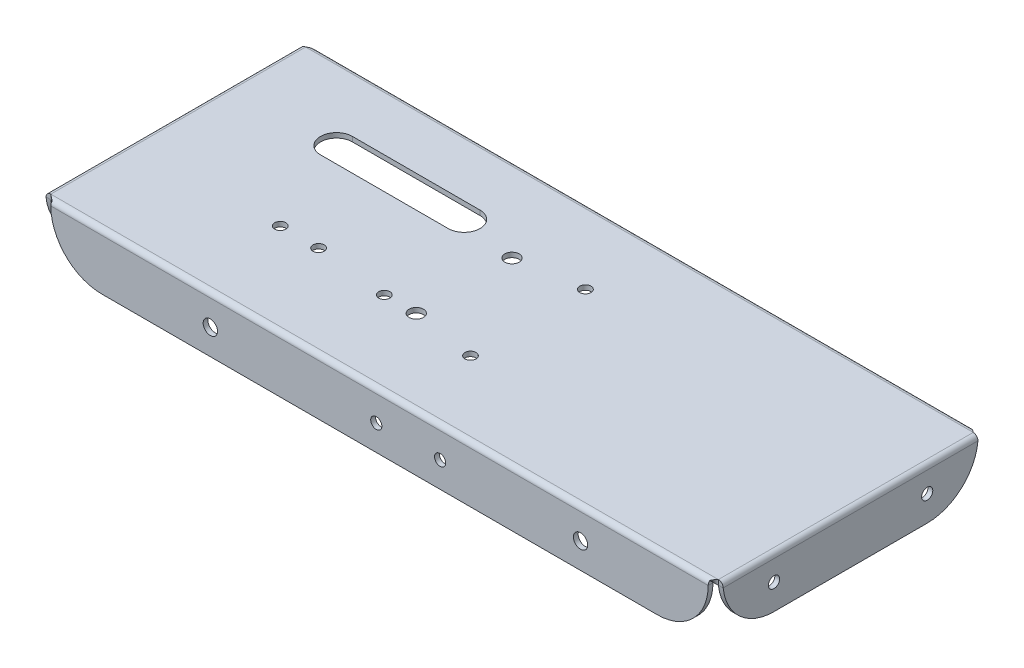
ISO-10303-21;
HEADER;
FILE_DESCRIPTION(('STEP AP214'),'2;1');
FILE_NAME('part.step','',(''),(''),'','','');
FILE_SCHEMA(('AUTOMOTIVE_DESIGN { 1 0 10303 214 1 1 1 1 }'));
ENDSEC;
DATA;
#1=APPLICATION_CONTEXT('core data for automotive mechanical design processes');
#2=APPLICATION_PROTOCOL_DEFINITION('international standard','automotive_design',2000,#1);
#3=PRODUCT_CONTEXT('',#1,'mechanical');
#4=PRODUCT('Part','Part','',(#3));
#5=PRODUCT_RELATED_PRODUCT_CATEGORY('part','',(#4));
#6=PRODUCT_DEFINITION_FORMATION('','',#4);
#7=PRODUCT_DEFINITION_CONTEXT('part definition',#1,'design');
#8=PRODUCT_DEFINITION('design','',#6,#7);
#9=PRODUCT_DEFINITION_SHAPE('','',#8);
#10=(LENGTH_UNIT() NAMED_UNIT(*) SI_UNIT(.MILLI.,.METRE.));
#11=(NAMED_UNIT(*) PLANE_ANGLE_UNIT() SI_UNIT($,.RADIAN.));
#12=(NAMED_UNIT(*) SI_UNIT($,.STERADIAN.) SOLID_ANGLE_UNIT());
#13=UNCERTAINTY_MEASURE_WITH_UNIT(LENGTH_MEASURE(1.E-05),#10,'distance_accuracy_value','');
#14=(GEOMETRIC_REPRESENTATION_CONTEXT(3) GLOBAL_UNCERTAINTY_ASSIGNED_CONTEXT((#13)) GLOBAL_UNIT_ASSIGNED_CONTEXT((#10,
#11,#12)) REPRESENTATION_CONTEXT('',''));
#15=CARTESIAN_POINT('',(0.,0.,0.));
#16=DIRECTION('',(0.,0.,1.));
#17=DIRECTION('',(1.,0.,0.));
#18=AXIS2_PLACEMENT_3D('',#15,#16,#17);
#19=CARTESIAN_POINT('',(16.,-1.5,0.));
#20=DIRECTION('',(0.,-1.,0.));
#21=DIRECTION('',(0.,0.,-1.));
#22=AXIS2_PLACEMENT_3D('',#19,#20,#21);
#23=PLANE('',#22);
#24=CARTESIAN_POINT('',(43.,-1.5,-27.4));
#25=DIRECTION('',(0.,1.,0.));
#26=DIRECTION('',(0.,0.,1.));
#27=AXIS2_PLACEMENT_3D('',#24,#25,#26);
#28=CIRCLE('',#27,1.75);
#29=CARTESIAN_POINT('',(43.,-1.5,-25.65));
#30=VERTEX_POINT('',#29);
#31=EDGE_CURVE('E1480',#30,#30,#28,.T.);
#32=ORIENTED_EDGE('',*,*,#31,.T.);
#33=EDGE_LOOP('',(#32));
#34=FACE_BOUND('',#33,.T.);
#35=CARTESIAN_POINT('',(30.,-1.5,-58.));
#36=DIRECTION('',(0.,1.,0.));
#37=DIRECTION('',(0.,0.,1.));
#38=AXIS2_PLACEMENT_3D('',#35,#36,#37);
#39=CIRCLE('',#38,5.);
#40=CARTESIAN_POINT('',(30.,-1.5,-63.));
#41=VERTEX_POINT('',#40);
#42=CARTESIAN_POINT('',(30.,-1.5,-53.));
#43=VERTEX_POINT('',#42);
#44=EDGE_CURVE('E1501',#41,#43,#39,.T.);
#45=ORIENTED_EDGE('',*,*,#44,.T.);
#46=DIRECTION('',(1.,0.,0.));
#47=VECTOR('',#46,1.);
#48=CARTESIAN_POINT('',(70.,-1.5,-53.));
#49=LINE('',#48,#47);
#50=CARTESIAN_POINT('',(70.,-1.5,-53.));
#51=VERTEX_POINT('',#50);
#52=EDGE_CURVE('E1516',#43,#51,#49,.T.);
#53=ORIENTED_EDGE('',*,*,#52,.T.);
#54=CARTESIAN_POINT('',(70.,-1.5,-58.));
#55=DIRECTION('',(0.,1.,0.));
#56=DIRECTION('',(0.,0.,1.));
#57=AXIS2_PLACEMENT_3D('',#54,#55,#56);
#58=CIRCLE('',#57,5.);
#59=CARTESIAN_POINT('',(70.,-1.5,-63.));
#60=VERTEX_POINT('',#59);
#61=EDGE_CURVE('E1513',#51,#60,#58,.T.);
#62=ORIENTED_EDGE('',*,*,#61,.T.);
#63=DIRECTION('',(-1.,0.,0.));
#64=VECTOR('',#63,1.);
#65=CARTESIAN_POINT('',(30.,-1.5,-63.));
#66=LINE('',#65,#64);
#67=EDGE_CURVE('E1493',#60,#41,#66,.T.);
#68=ORIENTED_EDGE('',*,*,#67,.T.);
#69=EDGE_LOOP('',(#45,#53,#62,#68));
#70=FACE_BOUND('',#69,.T.);
#71=CARTESIAN_POINT('',(55.,-1.5,-27.4));
#72=DIRECTION('',(0.,1.,0.));
#73=DIRECTION('',(0.,0.,1.));
#74=AXIS2_PLACEMENT_3D('',#71,#72,#73);
#75=CIRCLE('',#74,1.75);
#76=CARTESIAN_POINT('',(55.,-1.5,-25.65));
#77=VERTEX_POINT('',#76);
#78=EDGE_CURVE('E1510',#77,#77,#75,.T.);
#79=ORIENTED_EDGE('',*,*,#78,.T.);
#80=EDGE_LOOP('',(#79));
#81=FACE_BOUND('',#80,.T.);
#82=CARTESIAN_POINT('',(108.,-1.5,-58.));
#83=DIRECTION('',(0.,1.,0.));
#84=DIRECTION('',(0.,0.,1.));
#85=AXIS2_PLACEMENT_3D('',#82,#83,#84);
#86=CIRCLE('',#85,1.75);
#87=CARTESIAN_POINT('',(108.,-1.5,-56.25));
#88=VERTEX_POINT('',#87);
#89=EDGE_CURVE('E1524',#88,#88,#86,.T.);
#90=ORIENTED_EDGE('',*,*,#89,.T.);
#91=EDGE_LOOP('',(#90));
#92=FACE_BOUND('',#91,.T.);
#93=CARTESIAN_POINT('',(108.,-1.5,-22.));
#94=DIRECTION('',(0.,1.,0.));
#95=DIRECTION('',(0.,0.,1.));
#96=AXIS2_PLACEMENT_3D('',#93,#94,#95);
#97=CIRCLE('',#96,1.75);
#98=CARTESIAN_POINT('',(108.,-1.5,-20.25));
#99=VERTEX_POINT('',#98);
#100=EDGE_CURVE('E1530',#99,#99,#97,.T.);
#101=ORIENTED_EDGE('',*,*,#100,.T.);
#102=EDGE_LOOP('',(#101));
#103=FACE_BOUND('',#102,.T.);
#104=CARTESIAN_POINT('',(78.,-1.5,-25.));
#105=DIRECTION('',(0.,1.,0.));
#106=DIRECTION('',(0.,0.,1.));
#107=AXIS2_PLACEMENT_3D('',#104,#105,#106);
#108=CIRCLE('',#107,1.75);
#109=CARTESIAN_POINT('',(78.,-1.5,-23.25));
#110=VERTEX_POINT('',#109);
#111=EDGE_CURVE('E1536',#110,#110,#108,.T.);
#112=ORIENTED_EDGE('',*,*,#111,.T.);
#113=EDGE_LOOP('',(#112));
#114=FACE_BOUND('',#113,.T.);
#115=CARTESIAN_POINT('',(88.,-1.5,-25.));
#116=DIRECTION('',(0.,1.,0.));
#117=DIRECTION('',(0.,0.,1.));
#118=AXIS2_PLACEMENT_3D('',#115,#116,#117);
#119=CIRCLE('',#118,2.25);
#120=CARTESIAN_POINT('',(88.,-1.5,-22.75));
#121=VERTEX_POINT('',#120);
#122=EDGE_CURVE('E1542',#121,#121,#119,.T.);
#123=ORIENTED_EDGE('',*,*,#122,.T.);
#124=EDGE_LOOP('',(#123));
#125=FACE_BOUND('',#124,.T.);
#126=CARTESIAN_POINT('',(88.,-1.5,-55.));
#127=DIRECTION('',(0.,1.,0.));
#128=DIRECTION('',(0.,0.,1.));
#129=AXIS2_PLACEMENT_3D('',#126,#127,#128);
#130=CIRCLE('',#129,2.25);
#131=CARTESIAN_POINT('',(88.,-1.5,-52.75));
#132=VERTEX_POINT('',#131);
#133=EDGE_CURVE('E1548',#132,#132,#130,.T.);
#134=ORIENTED_EDGE('',*,*,#133,.T.);
#135=EDGE_LOOP('',(#134));
#136=FACE_BOUND('',#135,.T.);
#137=DIRECTION('',(1.,0.,0.));
#138=VECTOR('',#137,1.);
#139=CARTESIAN_POINT('',(16.,-1.5,-79.9214484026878));
#140=LINE('',#139,#138);
#141=CARTESIAN_POINT('',(-1.5835026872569,-1.5,-79.9214484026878));
#142=VERTEX_POINT('',#141);
#143=CARTESIAN_POINT('',(207.583502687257,-1.5,-79.9214484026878));
#144=VERTEX_POINT('',#143);
#145=EDGE_CURVE('E1478',#142,#144,#140,.T.);
#146=ORIENTED_EDGE('',*,*,#145,.T.);
#147=DIRECTION('',(0.,0.,1.));
#148=VECTOR('',#147,1.);
#149=CARTESIAN_POINT('',(207.583502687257,-1.5,0.));
#150=LINE('',#149,#148);
#151=CARTESIAN_POINT('',(207.583502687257,-1.5,-0.0785515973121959));
#152=VERTEX_POINT('',#151);
#153=EDGE_CURVE('E1150',#144,#152,#150,.T.);
#154=ORIENTED_EDGE('',*,*,#153,.T.);
#155=DIRECTION('',(-1.,0.,0.));
#156=VECTOR('',#155,1.);
#157=CARTESIAN_POINT('',(16.,-1.5,-0.0785515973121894));
#158=LINE('',#157,#156);
#159=CARTESIAN_POINT('',(-1.58350268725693,-1.5,-0.0785515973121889));
#160=VERTEX_POINT('',#159);
#161=EDGE_CURVE('E1151',#152,#160,#158,.T.);
#162=ORIENTED_EDGE('',*,*,#161,.T.);
#163=DIRECTION('',(0.,0.,1.));
#164=VECTOR('',#163,1.);
#165=CARTESIAN_POINT('',(-1.58350268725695,-1.5,0.));
#166=LINE('',#165,#164);
#167=EDGE_CURVE('E1236',#142,#160,#166,.T.);
#168=ORIENTED_EDGE('',*,*,#167,.F.);
#169=EDGE_LOOP('',(#146,#154,#162,#168));
#170=FACE_BOUND('',#169,.T.);
#171=ADVANCED_FACE('F122',(#34,#70,#81,#92,#103,#114,#125,#136,#170),#23,.T.);
#172=CARTESIAN_POINT('',(16.,0.,0.));
#173=DIRECTION('',(0.,-1.,0.));
#174=DIRECTION('',(0.,0.,-1.));
#175=AXIS2_PLACEMENT_3D('',#172,#173,#174);
#176=PLANE('',#175);
#177=DIRECTION('',(0.,0.,1.));
#178=VECTOR('',#177,1.);
#179=CARTESIAN_POINT('',(207.583502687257,0.,0.));
#180=LINE('',#179,#178);
#181=CARTESIAN_POINT('',(207.583502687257,0.,-79.9214484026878));
#182=VERTEX_POINT('',#181);
#183=CARTESIAN_POINT('',(207.583502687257,0.,-0.0785515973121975));
#184=VERTEX_POINT('',#183);
#185=EDGE_CURVE('E1234',#182,#184,#180,.T.);
#186=ORIENTED_EDGE('',*,*,#185,.F.);
#187=DIRECTION('',(1.,0.,0.));
#188=VECTOR('',#187,1.);
#189=CARTESIAN_POINT('',(16.,0.,-79.9214484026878));
#190=LINE('',#189,#188);
#191=CARTESIAN_POINT('',(-1.58350268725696,0.,-79.9214484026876));
#192=VERTEX_POINT('',#191);
#193=EDGE_CURVE('E140',#192,#182,#190,.T.);
#194=ORIENTED_EDGE('',*,*,#193,.F.);
#195=DIRECTION('',(0.,0.,1.));
#196=VECTOR('',#195,1.);
#197=CARTESIAN_POINT('',(-1.58350268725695,0.,0.));
#198=LINE('',#197,#196);
#199=CARTESIAN_POINT('',(-1.58350268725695,0.,-0.0785515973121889));
#200=VERTEX_POINT('',#199);
#201=EDGE_CURVE('E133',#192,#200,#198,.T.);
#202=ORIENTED_EDGE('',*,*,#201,.T.);
#203=DIRECTION('',(-1.,0.,0.));
#204=VECTOR('',#203,1.);
#205=CARTESIAN_POINT('',(16.,0.,-0.0785515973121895));
#206=LINE('',#205,#204);
#207=EDGE_CURVE('E1149',#184,#200,#206,.T.);
#208=ORIENTED_EDGE('',*,*,#207,.F.);
#209=EDGE_LOOP('',(#186,#194,#202,#208));
#210=FACE_BOUND('',#209,.T.);
#211=CARTESIAN_POINT('',(43.,0.,-27.4));
#212=DIRECTION('',(0.,1.,0.));
#213=DIRECTION('',(0.,0.,1.));
#214=AXIS2_PLACEMENT_3D('',#211,#212,#213);
#215=CIRCLE('',#214,1.75);
#216=CARTESIAN_POINT('',(43.,0.,-25.65));
#217=VERTEX_POINT('',#216);
#218=EDGE_CURVE('E1484',#217,#217,#215,.T.);
#219=ORIENTED_EDGE('',*,*,#218,.F.);
#220=EDGE_LOOP('',(#219));
#221=FACE_BOUND('',#220,.T.);
#222=DIRECTION('',(1.,0.,0.));
#223=VECTOR('',#222,1.);
#224=CARTESIAN_POINT('',(70.,0.,-53.));
#225=LINE('',#224,#223);
#226=CARTESIAN_POINT('',(30.,0.,-53.));
#227=VERTEX_POINT('',#226);
#228=CARTESIAN_POINT('',(70.,0.,-53.));
#229=VERTEX_POINT('',#228);
#230=EDGE_CURVE('E1505',#227,#229,#225,.T.);
#231=ORIENTED_EDGE('',*,*,#230,.F.);
#232=CARTESIAN_POINT('',(30.,0.,-58.));
#233=DIRECTION('',(0.,1.,0.));
#234=DIRECTION('',(0.,0.,1.));
#235=AXIS2_PLACEMENT_3D('',#232,#233,#234);
#236=CIRCLE('',#235,5.);
#237=CARTESIAN_POINT('',(30.,0.,-63.));
#238=VERTEX_POINT('',#237);
#239=EDGE_CURVE('E1508',#238,#227,#236,.T.);
#240=ORIENTED_EDGE('',*,*,#239,.F.);
#241=DIRECTION('',(-1.,0.,0.));
#242=VECTOR('',#241,1.);
#243=CARTESIAN_POINT('',(30.,0.,-63.));
#244=LINE('',#243,#242);
#245=CARTESIAN_POINT('',(70.,0.,-63.));
#246=VERTEX_POINT('',#245);
#247=EDGE_CURVE('E1498',#246,#238,#244,.T.);
#248=ORIENTED_EDGE('',*,*,#247,.F.);
#249=CARTESIAN_POINT('',(70.,0.,-58.));
#250=DIRECTION('',(0.,1.,0.));
#251=DIRECTION('',(0.,0.,1.));
#252=AXIS2_PLACEMENT_3D('',#249,#250,#251);
#253=CIRCLE('',#252,5.);
#254=EDGE_CURVE('E1502',#229,#246,#253,.T.);
#255=ORIENTED_EDGE('',*,*,#254,.F.);
#256=EDGE_LOOP('',(#231,#240,#248,#255));
#257=FACE_BOUND('',#256,.T.);
#258=CARTESIAN_POINT('',(55.,0.,-27.4));
#259=DIRECTION('',(0.,1.,0.));
#260=DIRECTION('',(0.,0.,1.));
#261=AXIS2_PLACEMENT_3D('',#258,#259,#260);
#262=CIRCLE('',#261,1.75);
#263=CARTESIAN_POINT('',(55.,0.,-25.65));
#264=VERTEX_POINT('',#263);
#265=EDGE_CURVE('E1521',#264,#264,#262,.T.);
#266=ORIENTED_EDGE('',*,*,#265,.F.);
#267=EDGE_LOOP('',(#266));
#268=FACE_BOUND('',#267,.T.);
#269=CARTESIAN_POINT('',(108.,0.,-58.));
#270=DIRECTION('',(0.,1.,0.));
#271=DIRECTION('',(0.,0.,1.));
#272=AXIS2_PLACEMENT_3D('',#269,#270,#271);
#273=CIRCLE('',#272,1.75);
#274=CARTESIAN_POINT('',(108.,0.,-56.25));
#275=VERTEX_POINT('',#274);
#276=EDGE_CURVE('E1527',#275,#275,#273,.T.);
#277=ORIENTED_EDGE('',*,*,#276,.F.);
#278=EDGE_LOOP('',(#277));
#279=FACE_BOUND('',#278,.T.);
#280=CARTESIAN_POINT('',(108.,0.,-22.));
#281=DIRECTION('',(0.,1.,0.));
#282=DIRECTION('',(0.,0.,1.));
#283=AXIS2_PLACEMENT_3D('',#280,#281,#282);
#284=CIRCLE('',#283,1.75);
#285=CARTESIAN_POINT('',(108.,0.,-20.25));
#286=VERTEX_POINT('',#285);
#287=EDGE_CURVE('E1533',#286,#286,#284,.T.);
#288=ORIENTED_EDGE('',*,*,#287,.F.);
#289=EDGE_LOOP('',(#288));
#290=FACE_BOUND('',#289,.T.);
#291=CARTESIAN_POINT('',(78.,0.,-25.));
#292=DIRECTION('',(0.,1.,0.));
#293=DIRECTION('',(0.,0.,1.));
#294=AXIS2_PLACEMENT_3D('',#291,#292,#293);
#295=CIRCLE('',#294,1.75);
#296=CARTESIAN_POINT('',(78.,0.,-23.25));
#297=VERTEX_POINT('',#296);
#298=EDGE_CURVE('E1539',#297,#297,#295,.T.);
#299=ORIENTED_EDGE('',*,*,#298,.F.);
#300=EDGE_LOOP('',(#299));
#301=FACE_BOUND('',#300,.T.);
#302=CARTESIAN_POINT('',(88.,0.,-25.));
#303=DIRECTION('',(0.,1.,0.));
#304=DIRECTION('',(0.,0.,1.));
#305=AXIS2_PLACEMENT_3D('',#302,#303,#304);
#306=CIRCLE('',#305,2.25);
#307=CARTESIAN_POINT('',(88.,0.,-22.75));
#308=VERTEX_POINT('',#307);
#309=EDGE_CURVE('E1545',#308,#308,#306,.T.);
#310=ORIENTED_EDGE('',*,*,#309,.F.);
#311=EDGE_LOOP('',(#310));
#312=FACE_BOUND('',#311,.T.);
#313=CARTESIAN_POINT('',(88.,0.,-55.));
#314=DIRECTION('',(0.,1.,0.));
#315=DIRECTION('',(0.,0.,1.));
#316=AXIS2_PLACEMENT_3D('',#313,#314,#315);
#317=CIRCLE('',#316,2.25);
#318=CARTESIAN_POINT('',(88.,0.,-52.75));
#319=VERTEX_POINT('',#318);
#320=EDGE_CURVE('E1551',#319,#319,#317,.T.);
#321=ORIENTED_EDGE('',*,*,#320,.F.);
#322=EDGE_LOOP('',(#321));
#323=FACE_BOUND('',#322,.T.);
#324=ADVANCED_FACE('F124',(#210,#221,#257,#268,#279,#290,#301,#312,#323),#176,.F.);
#325=CARTESIAN_POINT('',(43.,-1.5,-27.4));
#326=DIRECTION('',(0.,1.,0.));
#327=DIRECTION('',(0.,0.,1.));
#328=AXIS2_PLACEMENT_3D('',#325,#326,#327);
#329=CYLINDRICAL_SURFACE('',#328,1.75);
#330=ORIENTED_EDGE('',*,*,#31,.F.);
#331=EDGE_LOOP('',(#330));
#332=FACE_BOUND('',#331,.T.);
#333=ORIENTED_EDGE('',*,*,#218,.T.);
#334=EDGE_LOOP('',(#333));
#335=FACE_BOUND('',#334,.T.);
#336=ADVANCED_FACE('F787',(#332,#335),#329,.F.);
#337=CARTESIAN_POINT('',(30.,-1.5,-58.));
#338=DIRECTION('',(0.,1.,0.));
#339=DIRECTION('',(0.,0.,1.));
#340=AXIS2_PLACEMENT_3D('',#337,#338,#339);
#341=CYLINDRICAL_SURFACE('',#340,5.);
#342=ORIENTED_EDGE('',*,*,#239,.T.);
#343=DIRECTION('',(0.,1.,0.));
#344=VECTOR('',#343,1.);
#345=CARTESIAN_POINT('',(30.,-1.5,-53.));
#346=LINE('',#345,#344);
#347=EDGE_CURVE('E1489',#43,#227,#346,.T.);
#348=ORIENTED_EDGE('',*,*,#347,.F.);
#349=ORIENTED_EDGE('',*,*,#44,.F.);
#350=DIRECTION('',(0.,1.,0.));
#351=VECTOR('',#350,1.);
#352=CARTESIAN_POINT('',(30.,-1.5,-63.));
#353=LINE('',#352,#351);
#354=EDGE_CURVE('E1487',#41,#238,#353,.T.);
#355=ORIENTED_EDGE('',*,*,#354,.T.);
#356=EDGE_LOOP('',(#342,#348,#349,#355));
#357=FACE_BOUND('',#356,.T.);
#358=ADVANCED_FACE('F793',(#357),#341,.F.);
#359=CARTESIAN_POINT('',(30.,-1.5,-63.));
#360=DIRECTION('',(0.,0.,-1.));
#361=DIRECTION('',(-1.,0.,0.));
#362=AXIS2_PLACEMENT_3D('',#359,#360,#361);
#363=PLANE('',#362);
#364=ORIENTED_EDGE('',*,*,#247,.T.);
#365=ORIENTED_EDGE('',*,*,#354,.F.);
#366=ORIENTED_EDGE('',*,*,#67,.F.);
#367=DIRECTION('',(0.,1.,0.));
#368=VECTOR('',#367,1.);
#369=CARTESIAN_POINT('',(70.,-1.5,-63.));
#370=LINE('',#369,#368);
#371=EDGE_CURVE('E1495',#60,#246,#370,.T.);
#372=ORIENTED_EDGE('',*,*,#371,.T.);
#373=EDGE_LOOP('',(#364,#365,#366,#372));
#374=FACE_BOUND('',#373,.T.);
#375=ADVANCED_FACE('F797',(#374),#363,.F.);
#376=CARTESIAN_POINT('',(70.,-1.5,-58.));
#377=DIRECTION('',(0.,1.,0.));
#378=DIRECTION('',(0.,0.,1.));
#379=AXIS2_PLACEMENT_3D('',#376,#377,#378);
#380=CYLINDRICAL_SURFACE('',#379,5.);
#381=ORIENTED_EDGE('',*,*,#254,.T.);
#382=ORIENTED_EDGE('',*,*,#371,.F.);
#383=ORIENTED_EDGE('',*,*,#61,.F.);
#384=DIRECTION('',(0.,1.,0.));
#385=VECTOR('',#384,1.);
#386=CARTESIAN_POINT('',(70.,-1.5,-53.));
#387=LINE('',#386,#385);
#388=EDGE_CURVE('E1492',#51,#229,#387,.T.);
#389=ORIENTED_EDGE('',*,*,#388,.T.);
#390=EDGE_LOOP('',(#381,#382,#383,#389));
#391=FACE_BOUND('',#390,.T.);
#392=ADVANCED_FACE('F803',(#391),#380,.F.);
#393=CARTESIAN_POINT('',(70.,-1.5,-53.));
#394=DIRECTION('',(0.,0.,1.));
#395=DIRECTION('',(1.,0.,0.));
#396=AXIS2_PLACEMENT_3D('',#393,#394,#395);
#397=PLANE('',#396);
#398=ORIENTED_EDGE('',*,*,#230,.T.);
#399=ORIENTED_EDGE('',*,*,#388,.F.);
#400=ORIENTED_EDGE('',*,*,#52,.F.);
#401=ORIENTED_EDGE('',*,*,#347,.T.);
#402=EDGE_LOOP('',(#398,#399,#400,#401));
#403=FACE_BOUND('',#402,.T.);
#404=ADVANCED_FACE('F799',(#403),#397,.F.);
#405=CARTESIAN_POINT('',(55.,-1.5,-27.4));
#406=DIRECTION('',(0.,1.,0.));
#407=DIRECTION('',(0.,0.,1.));
#408=AXIS2_PLACEMENT_3D('',#405,#406,#407);
#409=CYLINDRICAL_SURFACE('',#408,1.75);
#410=ORIENTED_EDGE('',*,*,#78,.F.);
#411=EDGE_LOOP('',(#410));
#412=FACE_BOUND('',#411,.T.);
#413=ORIENTED_EDGE('',*,*,#265,.T.);
#414=EDGE_LOOP('',(#413));
#415=FACE_BOUND('',#414,.T.);
#416=ADVANCED_FACE('F802',(#412,#415),#409,.F.);
#417=CARTESIAN_POINT('',(108.,-1.5,-58.));
#418=DIRECTION('',(0.,1.,0.));
#419=DIRECTION('',(0.,0.,1.));
#420=AXIS2_PLACEMENT_3D('',#417,#418,#419);
#421=CYLINDRICAL_SURFACE('',#420,1.75);
#422=ORIENTED_EDGE('',*,*,#89,.F.);
#423=EDGE_LOOP('',(#422));
#424=FACE_BOUND('',#423,.T.);
#425=ORIENTED_EDGE('',*,*,#276,.T.);
#426=EDGE_LOOP('',(#425));
#427=FACE_BOUND('',#426,.T.);
#428=ADVANCED_FACE('F813',(#424,#427),#421,.F.);
#429=CARTESIAN_POINT('',(108.,-1.5,-22.));
#430=DIRECTION('',(0.,1.,0.));
#431=DIRECTION('',(0.,0.,1.));
#432=AXIS2_PLACEMENT_3D('',#429,#430,#431);
#433=CYLINDRICAL_SURFACE('',#432,1.75);
#434=ORIENTED_EDGE('',*,*,#100,.F.);
#435=EDGE_LOOP('',(#434));
#436=FACE_BOUND('',#435,.T.);
#437=ORIENTED_EDGE('',*,*,#287,.T.);
#438=EDGE_LOOP('',(#437));
#439=FACE_BOUND('',#438,.T.);
#440=ADVANCED_FACE('F817',(#436,#439),#433,.F.);
#441=CARTESIAN_POINT('',(78.,-1.5,-25.));
#442=DIRECTION('',(0.,1.,0.));
#443=DIRECTION('',(0.,0.,1.));
#444=AXIS2_PLACEMENT_3D('',#441,#442,#443);
#445=CYLINDRICAL_SURFACE('',#444,1.75);
#446=ORIENTED_EDGE('',*,*,#111,.F.);
#447=EDGE_LOOP('',(#446));
#448=FACE_BOUND('',#447,.T.);
#449=ORIENTED_EDGE('',*,*,#298,.T.);
#450=EDGE_LOOP('',(#449));
#451=FACE_BOUND('',#450,.T.);
#452=ADVANCED_FACE('F821',(#448,#451),#445,.F.);
#453=CARTESIAN_POINT('',(88.,-1.5,-25.));
#454=DIRECTION('',(0.,1.,0.));
#455=DIRECTION('',(0.,0.,1.));
#456=AXIS2_PLACEMENT_3D('',#453,#454,#455);
#457=CYLINDRICAL_SURFACE('',#456,2.25);
#458=ORIENTED_EDGE('',*,*,#122,.F.);
#459=EDGE_LOOP('',(#458));
#460=FACE_BOUND('',#459,.T.);
#461=ORIENTED_EDGE('',*,*,#309,.T.);
#462=EDGE_LOOP('',(#461));
#463=FACE_BOUND('',#462,.T.);
#464=ADVANCED_FACE('F825',(#460,#463),#457,.F.);
#465=CARTESIAN_POINT('',(88.,-1.5,-55.));
#466=DIRECTION('',(0.,1.,0.));
#467=DIRECTION('',(0.,0.,1.));
#468=AXIS2_PLACEMENT_3D('',#465,#466,#467);
#469=CYLINDRICAL_SURFACE('',#468,2.25);
#470=ORIENTED_EDGE('',*,*,#133,.F.);
#471=EDGE_LOOP('',(#470));
#472=FACE_BOUND('',#471,.T.);
#473=ORIENTED_EDGE('',*,*,#320,.T.);
#474=EDGE_LOOP('',(#473));
#475=FACE_BOUND('',#474,.T.);
#476=ADVANCED_FACE('F829',(#472,#475),#469,.F.);
#477=CARTESIAN_POINT('',(-1.5835026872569,0.015,-79.9214484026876));
#478=CARTESIAN_POINT('',(-1.31956700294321,0.0150000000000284,-80.1328661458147));
#479=CARTESIAN_POINT('',(-1.05566845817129,-0.0270341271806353,-80.3441712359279));
#480=CARTESIAN_POINT('',(-0.527834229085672,-0.188834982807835,-80.7347930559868));
#481=CARTESIAN_POINT('',(-0.263935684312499,-0.308527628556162,-80.9139309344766));
#482=CARTESIAN_POINT('',(0.,-0.458022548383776,-81.0634258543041));
#483=CARTESIAN_POINT('',(-1.5835026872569,0.,-79.9214484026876));
#484=CARTESIAN_POINT('',(-1.31956718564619,0.,-80.1309025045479));
#485=CARTESIAN_POINT('',(-1.05566845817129,-0.0416437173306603,-80.3402450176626));
#486=CARTESIAN_POINT('',(-0.527834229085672,-0.201941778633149,-80.7272387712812));
#487=CARTESIAN_POINT('',(-0.263935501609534,-0.320522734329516,-80.9047128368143));
#488=CARTESIAN_POINT('',(0.,-0.468629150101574,-81.0528192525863));
#489=CARTESIAN_POINT('',(-1.5835026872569,-1.5,-79.9214484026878));
#490=CARTESIAN_POINT('',(-1.31958545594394,-1.5,-79.9345383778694));
#491=CARTESIAN_POINT('',(-1.05566845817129,-1.50260273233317,-79.9476231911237));
#492=CARTESIAN_POINT('',(-0.527834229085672,-1.51262136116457,-79.9718103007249));
#493=CARTESIAN_POINT('',(-0.263917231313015,-1.52003331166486,-79.98290307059));
#494=CARTESIAN_POINT('',(0.,-1.52928932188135,-79.9921590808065));
#495=B_SPLINE_SURFACE_WITH_KNOTS('',1,3,((#477,#478,#479,#480,#481,#482),(#483,#484,#485,#486,
#487,#488),(#489,#490,#491,#492,#493,#494)),.UNSPECIFIED.,.F.,.F.,.F.,(2,1,2),(4,2,4),(-0.01,0.,
1.),(0.,0.5,1.),.UNSPECIFIED.);
#496=CARTESIAN_POINT('',(-1.58350268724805,0.,-79.9214484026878));
#497=CARTESIAN_POINT('',(-1.5835026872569,-1.5,-79.9214484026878));
#498=B_SPLINE_CURVE_WITH_KNOTS('',1,(#496,#497),.UNSPECIFIED.,.F.,.F.,(2,2),(0.,1.),.UNSPECIFIED.);
#499=EDGE_CURVE('E12',#192,#142,#498,.T.);
#500=CARTESIAN_POINT('',(-1.5835026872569,0.,-79.9214484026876));
#501=CARTESIAN_POINT('',(-1.49347333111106,3.1618465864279E-05,-79.9928907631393));
#502=CARTESIAN_POINT('',(-1.4034459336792,-0.00478335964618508,-80.064332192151));
#503=CARTESIAN_POINT('',(-1.22342169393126,-0.0238812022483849,-80.2059187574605));
#504=CARTESIAN_POINT('',(-1.13342485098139,-0.0381610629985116,-80.2760642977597));
#505=CARTESIAN_POINT('',(-0.957595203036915,-0.0750891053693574,-80.4106249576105));
#506=CARTESIAN_POINT('',(-0.871762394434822,-0.0973195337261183,-80.4751550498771));
#507=CARTESIAN_POINT('',(-0.700097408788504,-0.149814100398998,-80.6008598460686));
#508=CARTESIAN_POINT('',(-0.614265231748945,-0.180078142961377,-80.6620345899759));
#509=CARTESIAN_POINT('',(-0.440374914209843,-0.249044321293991,-80.7815622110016));
#510=CARTESIAN_POINT('',(-0.352316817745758,-0.287945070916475,-80.8398006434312));
#511=CARTESIAN_POINT('',(-0.176173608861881,-0.373012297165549,-80.9507261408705));
#512=CARTESIAN_POINT('',(-0.0880884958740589,-0.419180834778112,-81.0034116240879));
#513=CARTESIAN_POINT('',(-5.00015130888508E-07,-0.468628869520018,-81.0528189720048));
#514=B_SPLINE_CURVE_WITH_KNOTS('',3,(#500,#501,#502,#503,#504,#505,#506,#507,#508,#509,#510,
#511,#512,#513),.UNSPECIFIED.,.F.,.F.,(4,2,2,2,2,2,4),(0.,0.344692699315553,0.689276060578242,
1.01791629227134,1.34655260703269,1.68371824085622,2.02097966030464),.UNSPECIFIED.);
#515=CARTESIAN_POINT('',(-5.00015098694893E-07,-0.468628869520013,-81.0528189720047));
#516=VERTEX_POINT('',#515);
#517=EDGE_CURVE('E974',#192,#516,#514,.T.);
#518=CARTESIAN_POINT('',(0.,-0.458022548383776,-81.0634258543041));
#519=CARTESIAN_POINT('',(0.,-0.468629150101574,-81.0528192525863));
#520=CARTESIAN_POINT('',(0.,-1.52928932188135,-79.9921590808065));
#521=B_SPLINE_CURVE_WITH_KNOTS('',1,(#518,#519,#520),.UNSPECIFIED.,.F.,.F.,(2,1,2),(-0.01,0.,
1.),.UNSPECIFIED.);
#522=CARTESIAN_POINT('',(0.,-1.52928932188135,-79.9921590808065));
#523=VERTEX_POINT('',#522);
#524=EDGE_CURVE('E946',#516,#523,#521,.T.);
#525=CARTESIAN_POINT('',(-1.5835026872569,-1.5,-79.9214484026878));
#526=CARTESIAN_POINT('',(-1.5175234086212,-1.49999944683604,-79.9247209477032));
#527=CARTESIAN_POINT('',(-1.4515441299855,-1.50016061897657,-79.927993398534));
#528=CARTESIAN_POINT('',(-1.3195855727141,-1.50080243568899,-79.9345068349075));
#529=CARTESIAN_POINT('',(-1.25360629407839,-1.50128308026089,-79.9377478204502));
#530=CARTESIAN_POINT('',(-1.12164773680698,-1.50255986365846,-79.9441670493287));
#531=CARTESIAN_POINT('',(-1.05566845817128,-1.50335600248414,-79.9473452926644));
#532=CARTESIAN_POINT('',(-0.923709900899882,-1.50525593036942,-79.9536084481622));
#533=CARTESIAN_POINT('',(-0.857730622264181,-1.50635971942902,-79.9566933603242));
#534=CARTESIAN_POINT('',(-0.725772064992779,-1.50886437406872,-79.9627401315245));
#535=CARTESIAN_POINT('',(-0.659792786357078,-1.51026523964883,-79.9657019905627));
#536=CARTESIAN_POINT('',(-0.527834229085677,-1.51335050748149,-79.9714741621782));
#537=CARTESIAN_POINT('',(-0.461854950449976,-1.51503490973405,-79.9742844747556));
#538=CARTESIAN_POINT('',(-0.329896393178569,-1.51867116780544,-79.979726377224));
#539=CARTESIAN_POINT('',(-0.263917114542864,-1.52062302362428,-79.9823579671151));
#540=CARTESIAN_POINT('',(-0.131958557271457,-1.52477488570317,-79.9874174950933));
#541=CARTESIAN_POINT('',(-0.0659792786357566,-1.52697489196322,-79.9898454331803));
#542=CARTESIAN_POINT('',(0.,-1.52928932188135,-79.9921590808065));
#543=B_SPLINE_CURVE_WITH_KNOTS('',3,(#525,#526,#527,#528,#529,#530,#531,#532,#533,#534,#535,
#536,#537,#538,#539,#540,#541,#542),.UNSPECIFIED.,.F.,.F.,(4,2,2,2,2,2,2,2,4),(0.,
0.198180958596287,0.396361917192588,0.594542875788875,0.792723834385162,0.990904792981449,
1.18908575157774,1.38726671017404,1.58544766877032),.UNSPECIFIED.);
#544=EDGE_CURVE('E975',#142,#523,#543,.T.);
#545=ORIENTED_EDGE('',*,*,#499,.F.);
#546=ORIENTED_EDGE('',*,*,#517,.T.);
#547=ORIENTED_EDGE('',*,*,#524,.T.);
#548=ORIENTED_EDGE('',*,*,#544,.F.);
#549=EDGE_LOOP('',(#545,#546,#547,#548));
#550=FACE_BOUND('',#549,.T.);
#551=ADVANCED_FACE('F833',(#550),#495,.F.);
#552=CARTESIAN_POINT('',(0.,-0.468629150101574,-81.0528192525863));
#553=CARTESIAN_POINT('',(7.81929918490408E-06,-0.614431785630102,-81.1986218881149));
#554=CARTESIAN_POINT('',(2.7798184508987E-05,-0.789973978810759,-81.3170567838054));
#555=CARTESIAN_POINT('',(9.20730868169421E-05,-1.17647987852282,-81.4785275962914));
#556=CARTESIAN_POINT('',(0.000136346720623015,-1.38724041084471,-81.5214484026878));
#557=CARTESIAN_POINT('',(0.000192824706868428,-1.6,-81.5214484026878));
#558=CARTESIAN_POINT('',(0.,-1.52928932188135,-79.9921590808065));
#559=CARTESIAN_POINT('',(7.81929918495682E-06,-1.53840198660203,-80.0012717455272));
#560=CARTESIAN_POINT('',(2.77981845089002E-05,-1.54937337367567,-80.0086739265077));
#561=CARTESIAN_POINT('',(9.20730868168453E-05,-1.57352999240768,-80.0187658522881));
#562=CARTESIAN_POINT('',(0.000136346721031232,-1.58670252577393,-80.0214484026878));
#563=CARTESIAN_POINT('',(0.000192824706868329,-1.6,-80.0214484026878));
#564=B_SPLINE_SURFACE_WITH_KNOTS('',1,3,((#552,#553,#554,#555,#556,#557),(#558,#559,#560,#561,
#562,#563)),.UNSPECIFIED.,.F.,.F.,.F.,(2,2),(4,2,4),(0.,1.),(0.,0.5,1.),.UNSPECIFIED.);
#565=CARTESIAN_POINT('',(0.,-0.468629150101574,-81.0528192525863));
#566=CARTESIAN_POINT('',(7.81929918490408E-06,-0.614431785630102,-81.1986218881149));
#567=CARTESIAN_POINT('',(2.7798184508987E-05,-0.789973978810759,-81.3170567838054));
#568=CARTESIAN_POINT('',(9.20730868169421E-05,-1.17647987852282,-81.4785275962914));
#569=CARTESIAN_POINT('',(0.000136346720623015,-1.38724041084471,-81.5214484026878));
#570=CARTESIAN_POINT('',(0.000192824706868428,-1.6,-81.5214484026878));
#571=B_SPLINE_CURVE_WITH_KNOTS('',3,(#565,#566,#567,#568,#569,#570),.UNSPECIFIED.,.F.,.F.,(4,2,
4),(0.,0.5,1.),.UNSPECIFIED.);
#572=CARTESIAN_POINT('',(0.00019282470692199,-1.6,-81.5214484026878));
#573=VERTEX_POINT('',#572);
#574=EDGE_CURVE('E1599',#516,#573,#571,.T.);
#575=CARTESIAN_POINT('',(0.000192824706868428,-1.6,-81.5214484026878));
#576=CARTESIAN_POINT('',(0.000192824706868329,-1.6,-80.0214484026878));
#577=B_SPLINE_CURVE_WITH_KNOTS('',1,(#575,#576),.UNSPECIFIED.,.F.,.F.,(2,2),(0.,1.),.UNSPECIFIED.);
#578=CARTESIAN_POINT('',(0.00019282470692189,-1.6,-80.0214484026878));
#579=VERTEX_POINT('',#578);
#580=EDGE_CURVE('E933',#573,#579,#577,.T.);
#581=CARTESIAN_POINT('',(0.000192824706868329,-1.6,-80.0214484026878));
#582=CARTESIAN_POINT('',(0.000136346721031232,-1.58670252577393,-80.0214484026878));
#583=CARTESIAN_POINT('',(9.20730868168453E-05,-1.57352999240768,-80.0187658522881));
#584=CARTESIAN_POINT('',(2.77981845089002E-05,-1.54937337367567,-80.0086739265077));
#585=CARTESIAN_POINT('',(7.81929918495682E-06,-1.53840198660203,-80.0012717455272));
#586=CARTESIAN_POINT('',(0.,-1.52928932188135,-79.9921590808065));
#587=B_SPLINE_CURVE_WITH_KNOTS('',3,(#581,#582,#583,#584,#585,#586),.UNSPECIFIED.,.F.,.F.,(4,2,
4),(0.,0.5,1.),.UNSPECIFIED.);
#588=EDGE_CURVE('E1062',#523,#579,#587,.F.);
#589=ORIENTED_EDGE('',*,*,#524,.F.);
#590=ORIENTED_EDGE('',*,*,#574,.T.);
#591=ORIENTED_EDGE('',*,*,#580,.T.);
#592=ORIENTED_EDGE('',*,*,#588,.F.);
#593=EDGE_LOOP('',(#589,#590,#591,#592));
#594=FACE_BOUND('',#593,.T.);
#595=ADVANCED_FACE('F892',(#594),#564,.F.);
#596=CARTESIAN_POINT('',(205.999807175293,-1.6,-81.5214484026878));
#597=CARTESIAN_POINT('',(205.999863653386,-1.38724000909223,-81.5214484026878));
#598=CARTESIAN_POINT('',(205.999907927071,-1.17647930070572,-81.4785274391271));
#599=CARTESIAN_POINT('',(205.999972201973,-0.789973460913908,-81.3170564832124));
#600=CARTESIAN_POINT('',(205.999992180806,-0.614431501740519,-81.1986216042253));
#601=CARTESIAN_POINT('',(206.,-0.468629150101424,-81.0528192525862));
#602=CARTESIAN_POINT('',(205.999807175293,-1.6,-80.0214484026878));
#603=CARTESIAN_POINT('',(205.999863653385,-1.5867025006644,-80.0214484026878));
#604=CARTESIAN_POINT('',(205.999907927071,-1.57352995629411,-80.0187658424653));
#605=CARTESIAN_POINT('',(205.999972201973,-1.54937334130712,-80.0086739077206));
#606=CARTESIAN_POINT('',(205.999992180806,-1.53840196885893,-80.0012717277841));
#607=CARTESIAN_POINT('',(206.,-1.52928932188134,-79.9921590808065));
#608=B_SPLINE_SURFACE_WITH_KNOTS('',1,3,((#596,#597,#598,#599,#600,#601),(#602,#603,#604,#605,
#606,#607)),.UNSPECIFIED.,.F.,.F.,.F.,(2,2),(4,2,4),(0.,1.),(0.,0.5,1.),.UNSPECIFIED.);
#609=CARTESIAN_POINT('',(205.999807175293,-1.6,-80.0214484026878));
#610=CARTESIAN_POINT('',(205.999807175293,-1.6,-81.5214484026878));
#611=B_SPLINE_CURVE_WITH_KNOTS('',1,(#609,#610),.UNSPECIFIED.,.F.,.F.,(2,2),(0.,1.),.UNSPECIFIED.);
#612=CARTESIAN_POINT('',(205.999807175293,-1.6,-80.0214484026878));
#613=VERTEX_POINT('',#612);
#614=CARTESIAN_POINT('',(205.999807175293,-1.6,-81.5214484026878));
#615=VERTEX_POINT('',#614);
#616=EDGE_CURVE('E1412',#613,#615,#611,.T.);
#617=CARTESIAN_POINT('',(205.999807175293,-1.6,-81.5214484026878));
#618=CARTESIAN_POINT('',(205.999863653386,-1.38724000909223,-81.5214484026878));
#619=CARTESIAN_POINT('',(205.999907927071,-1.17647930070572,-81.4785274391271));
#620=CARTESIAN_POINT('',(205.999972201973,-0.789973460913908,-81.3170564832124));
#621=CARTESIAN_POINT('',(205.999992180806,-0.614431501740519,-81.1986216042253));
#622=CARTESIAN_POINT('',(206.,-0.468629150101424,-81.0528192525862));
#623=B_SPLINE_CURVE_WITH_KNOTS('',3,(#617,#618,#619,#620,#621,#622),.UNSPECIFIED.,.F.,.F.,(4,2,
4),(0.,0.5,1.),.UNSPECIFIED.);
#624=CARTESIAN_POINT('',(205.999999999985,-0.46862943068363,-81.0528195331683));
#625=VERTEX_POINT('',#624);
#626=EDGE_CURVE('E1125',#615,#625,#623,.T.);
#627=CARTESIAN_POINT('',(206.,-0.468629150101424,-81.0528192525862));
#628=CARTESIAN_POINT('',(206.,-1.52928932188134,-79.9921590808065));
#629=B_SPLINE_CURVE_WITH_KNOTS('',1,(#627,#628),.UNSPECIFIED.,.F.,.F.,(2,2),(0.,1.),.UNSPECIFIED.);
#630=CARTESIAN_POINT('',(206.,-1.52928932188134,-79.9921590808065));
#631=VERTEX_POINT('',#630);
#632=EDGE_CURVE('E877',#625,#631,#629,.T.);
#633=CARTESIAN_POINT('',(206.,-1.52928932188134,-79.9921590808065));
#634=CARTESIAN_POINT('',(205.999992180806,-1.53840196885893,-80.0012717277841));
#635=CARTESIAN_POINT('',(205.999972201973,-1.54937334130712,-80.0086739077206));
#636=CARTESIAN_POINT('',(205.999907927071,-1.57352995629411,-80.0187658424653));
#637=CARTESIAN_POINT('',(205.999863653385,-1.5867025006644,-80.0214484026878));
#638=CARTESIAN_POINT('',(205.999807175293,-1.6,-80.0214484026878));
#639=B_SPLINE_CURVE_WITH_KNOTS('',3,(#633,#634,#635,#636,#637,#638),.UNSPECIFIED.,.F.,.F.,(4,2,
4),(0.,0.5,1.),.UNSPECIFIED.);
#640=EDGE_CURVE('E1106',#613,#631,#639,.F.);
#641=ORIENTED_EDGE('',*,*,#616,.T.);
#642=ORIENTED_EDGE('',*,*,#626,.T.);
#643=ORIENTED_EDGE('',*,*,#632,.T.);
#644=ORIENTED_EDGE('',*,*,#640,.F.);
#645=EDGE_LOOP('',(#641,#642,#643,#644));
#646=FACE_BOUND('',#645,.T.);
#647=ADVANCED_FACE('F842',(#646),#608,.F.);
#648=CARTESIAN_POINT('',(205.984163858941,-0.466992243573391,-81.0723955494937));
#649=CARTESIAN_POINT('',(205.989442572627,-0.464002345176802,-81.0694056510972));
#650=CARTESIAN_POINT('',(205.994721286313,-0.461012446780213,-81.0664157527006));
#651=CARTESIAN_POINT('',(206.,-0.458022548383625,-81.063425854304));
#652=CARTESIAN_POINT('',(206.263935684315,-0.308527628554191,-80.9139309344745));
#653=CARTESIAN_POINT('',(206.527834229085,-0.18883498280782,-80.7347930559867));
#654=CARTESIAN_POINT('',(207.055668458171,-0.0270341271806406,-80.3441712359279));
#655=CARTESIAN_POINT('',(207.319567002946,0.0150000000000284,-80.1328661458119));
#656=CARTESIAN_POINT('',(207.583502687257,0.015,-79.9214484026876));
#657=CARTESIAN_POINT('',(205.984163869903,-0.477515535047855,-81.0617056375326));
#658=CARTESIAN_POINT('',(205.989442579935,-0.474553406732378,-81.0587435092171));
#659=CARTESIAN_POINT('',(205.994721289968,-0.471591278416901,-81.0557813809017));
#660=CARTESIAN_POINT('',(206.,-0.468629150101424,-81.0528192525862));
#661=CARTESIAN_POINT('',(206.263935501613,-0.320522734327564,-80.9047128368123));
#662=CARTESIAN_POINT('',(206.527834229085,-0.201941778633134,-80.7272387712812));
#663=CARTESIAN_POINT('',(207.055668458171,-0.0416437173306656,-80.3402450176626));
#664=CARTESIAN_POINT('',(207.319567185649,0.,-80.1309025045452));
#665=CARTESIAN_POINT('',(207.583502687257,0.,-79.9214484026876));
#666=CARTESIAN_POINT('',(205.984164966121,-1.52984468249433,-79.9927144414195));
#667=CARTESIAN_POINT('',(205.989443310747,-1.52965956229,-79.9925293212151));
#668=CARTESIAN_POINT('',(205.994721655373,-1.52947444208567,-79.9923442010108));
#669=CARTESIAN_POINT('',(206.,-1.52928932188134,-79.9921590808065));
#670=CARTESIAN_POINT('',(206.263917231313,-1.52003331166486,-79.98290307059));
#671=CARTESIAN_POINT('',(206.527834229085,-1.51262136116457,-79.9718103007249));
#672=CARTESIAN_POINT('',(207.055668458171,-1.50260273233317,-79.9476231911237));
#673=CARTESIAN_POINT('',(207.319585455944,-1.5,-79.9345383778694));
#674=CARTESIAN_POINT('',(207.583502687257,-1.5,-79.9214484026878));
#675=B_SPLINE_SURFACE_WITH_KNOTS('',1,3,((#648,#649,#650,#651,#652,#653,#654,#655,#656),(#657,
#658,#659,#660,#661,#662,#663,#664,#665),(#666,#667,#668,#669,#670,#671,#672,#673,#674)),
.UNSPECIFIED.,.F.,.F.,.F.,(2,1,2),(4,3,2,4),(-0.01,0.,1.),(-0.01,0.,0.5,1.),.UNSPECIFIED.);
#676=CARTESIAN_POINT('',(205.999999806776,-0.468629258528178,-81.052819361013));
#677=CARTESIAN_POINT('',(206.090029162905,-0.418089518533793,-81.0023243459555));
#678=CARTESIAN_POINT('',(206.180056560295,-0.370977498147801,-80.9484029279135));
#679=CARTESIAN_POINT('',(206.360080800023,-0.28436488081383,-80.8347819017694));
#680=CARTESIAN_POINT('',(206.450077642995,-0.244861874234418,-80.7750841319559));
#681=CARTESIAN_POINT('',(206.625907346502,-0.175825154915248,-80.6538232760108));
#682=CARTESIAN_POINT('',(206.711740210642,-0.145914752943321,-80.5924742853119));
#683=CARTESIAN_POINT('',(206.883405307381,-0.0941472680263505,-80.466468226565));
#684=CARTESIAN_POINT('',(206.969237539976,-0.0722900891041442,-80.4018111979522));
#685=CARTESIAN_POINT('',(207.143127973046,-0.0365377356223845,-80.2685258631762));
#686=CARTESIAN_POINT('',(207.231186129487,-0.0228639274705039,-80.1998380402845));
#687=CARTESIAN_POINT('',(207.40732945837,-0.00457937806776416,-80.0612501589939));
#688=CARTESIAN_POINT('',(207.495414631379,2.87873436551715E-05,-79.9913497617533));
#689=CARTESIAN_POINT('',(207.583502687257,0.,-79.9214484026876));
#690=B_SPLINE_CURVE_WITH_KNOTS('',3,(#676,#677,#678,#679,#680,#681,#682,#683,#684,#685,#686,
#687,#688,#689),.UNSPECIFIED.,.F.,.F.,(4,2,2,2,2,2,4),(0.,0.344692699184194,0.689276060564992,
1.01791650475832,1.34655303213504,1.68371889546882,2.02098054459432),.UNSPECIFIED.);
#691=EDGE_CURVE('E1063',#625,#182,#690,.T.);
#692=CARTESIAN_POINT('',(207.583502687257,-1.5,-79.9214484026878));
#693=CARTESIAN_POINT('',(207.583502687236,0.,-79.9214484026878));
#694=B_SPLINE_CURVE_WITH_KNOTS('',1,(#692,#693),.UNSPECIFIED.,.F.,.F.,(2,2),(0.,1.),.UNSPECIFIED.);
#695=EDGE_CURVE('E608',#144,#182,#694,.T.);
#696=CARTESIAN_POINT('',(206.,-1.52928932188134,-79.9921590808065));
#697=CARTESIAN_POINT('',(206.065979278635,-1.52697489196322,-79.9898454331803));
#698=CARTESIAN_POINT('',(206.131958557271,-1.52477488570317,-79.9874174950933));
#699=CARTESIAN_POINT('',(206.263917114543,-1.52062302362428,-79.9823579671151));
#700=CARTESIAN_POINT('',(206.329896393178,-1.51867116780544,-79.979726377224));
#701=CARTESIAN_POINT('',(206.46185495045,-1.51503490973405,-79.9742844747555));
#702=CARTESIAN_POINT('',(206.527834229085,-1.51335050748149,-79.9714741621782));
#703=CARTESIAN_POINT('',(206.659792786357,-1.51026523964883,-79.9657019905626));
#704=CARTESIAN_POINT('',(206.725772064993,-1.50886437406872,-79.9627401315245));
#705=CARTESIAN_POINT('',(206.857730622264,-1.50635971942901,-79.9566933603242));
#706=CARTESIAN_POINT('',(206.9237099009,-1.50525593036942,-79.9536084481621));
#707=CARTESIAN_POINT('',(207.055668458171,-1.50335600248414,-79.9473452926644));
#708=CARTESIAN_POINT('',(207.121647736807,-1.50255986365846,-79.9441670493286));
#709=CARTESIAN_POINT('',(207.253606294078,-1.50128308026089,-79.9377478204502));
#710=CARTESIAN_POINT('',(207.319585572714,-1.50080243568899,-79.9345068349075));
#711=CARTESIAN_POINT('',(207.451544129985,-1.50016061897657,-79.927993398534));
#712=CARTESIAN_POINT('',(207.517523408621,-1.49999944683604,-79.9247209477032));
#713=CARTESIAN_POINT('',(207.583502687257,-1.5,-79.9214484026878));
#714=B_SPLINE_CURVE_WITH_KNOTS('',3,(#696,#697,#698,#699,#700,#701,#702,#703,#704,#705,#706,
#707,#708,#709,#710,#711,#712,#713),.UNSPECIFIED.,.F.,.F.,(4,2,2,2,2,2,2,2,4),(0.,
0.198180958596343,0.396361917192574,0.594542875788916,0.792723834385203,0.99090479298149,
1.18908575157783,1.38726671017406,1.58544766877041),.UNSPECIFIED.);
#715=EDGE_CURVE('E1119',#631,#144,#714,.T.);
#716=ORIENTED_EDGE('',*,*,#691,.T.);
#717=ORIENTED_EDGE('',*,*,#695,.F.);
#718=ORIENTED_EDGE('',*,*,#715,.F.);
#719=ORIENTED_EDGE('',*,*,#632,.F.);
#720=EDGE_LOOP('',(#716,#717,#718,#719));
#721=FACE_BOUND('',#720,.T.);
#722=ADVANCED_FACE('F835',(#721),#675,.F.);
#723=CARTESIAN_POINT('',(-106.172442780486,-1.6,-79.9214484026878));
#724=DIRECTION('',(1.,0.,0.));
#725=DIRECTION('',(0.,0.,-1.));
#726=AXIS2_PLACEMENT_3D('',#723,#724,#725);
#727=CYLINDRICAL_SURFACE('',#726,0.1);
#728=ORIENTED_EDGE('',*,*,#640,.T.);
#729=ORIENTED_EDGE('',*,*,#715,.T.);
#730=ORIENTED_EDGE('',*,*,#145,.F.);
#731=ORIENTED_EDGE('',*,*,#544,.T.);
#732=ORIENTED_EDGE('',*,*,#588,.T.);
#733=DIRECTION('',(1.,0.,0.));
#734=VECTOR('',#733,1.);
#735=CARTESIAN_POINT('',(16.,-1.6,-80.0214484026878));
#736=LINE('',#735,#734);
#737=EDGE_CURVE('E1413',#579,#613,#736,.T.);
#738=ORIENTED_EDGE('',*,*,#737,.T.);
#739=EDGE_LOOP('',(#728,#729,#730,#731,#732,#738));
#740=FACE_BOUND('',#739,.T.);
#741=ADVANCED_FACE('F841',(#740),#727,.F.);
#742=CARTESIAN_POINT('',(-106.172442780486,-1.6,-79.9214484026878));
#743=DIRECTION('',(1.,0.,0.));
#744=DIRECTION('',(0.,0.,-1.));
#745=AXIS2_PLACEMENT_3D('',#742,#743,#744);
#746=CYLINDRICAL_SURFACE('',#745,1.6);
#747=ORIENTED_EDGE('',*,*,#626,.F.);
#748=DIRECTION('',(1.,0.,0.));
#749=VECTOR('',#748,1.);
#750=CARTESIAN_POINT('',(16.,-1.6,-81.5214484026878));
#751=LINE('',#750,#749);
#752=EDGE_CURVE('E1434',#573,#615,#751,.T.);
#753=ORIENTED_EDGE('',*,*,#752,.F.);
#754=ORIENTED_EDGE('',*,*,#574,.F.);
#755=ORIENTED_EDGE('',*,*,#517,.F.);
#756=ORIENTED_EDGE('',*,*,#193,.T.);
#757=ORIENTED_EDGE('',*,*,#691,.F.);
#758=EDGE_LOOP('',(#747,#753,#754,#755,#756,#757));
#759=FACE_BOUND('',#758,.T.);
#760=ADVANCED_FACE('F844',(#759),#746,.T.);
#761=CARTESIAN_POINT('',(50.,-9.5214484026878,-80.0214484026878));
#762=DIRECTION('',(0.,0.,-1.));
#763=DIRECTION('',(0.,1.,0.));
#764=AXIS2_PLACEMENT_3D('',#761,#762,#763);
#765=CYLINDRICAL_SURFACE('',#764,2.25);
#766=CARTESIAN_POINT('',(50.,-9.5214484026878,-80.0214484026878));
#767=DIRECTION('',(0.,0.,-1.));
#768=DIRECTION('',(0.,1.,0.));
#769=AXIS2_PLACEMENT_3D('',#766,#767,#768);
#770=CIRCLE('',#769,2.25);
#771=CARTESIAN_POINT('',(50.,-7.2714484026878,-80.0214484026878));
#772=VERTEX_POINT('',#771);
#773=EDGE_CURVE('E1382',#772,#772,#770,.T.);
#774=ORIENTED_EDGE('',*,*,#773,.F.);
#775=EDGE_LOOP('',(#774));
#776=FACE_BOUND('',#775,.T.);
#777=CARTESIAN_POINT('',(50.,-9.5214484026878,-81.5214484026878));
#778=DIRECTION('',(0.,0.,-1.));
#779=DIRECTION('',(0.,1.,0.));
#780=AXIS2_PLACEMENT_3D('',#777,#778,#779);
#781=CIRCLE('',#780,2.25);
#782=CARTESIAN_POINT('',(50.,-7.2714484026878,-81.5214484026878));
#783=VERTEX_POINT('',#782);
#784=EDGE_CURVE('E1097',#783,#783,#781,.T.);
#785=ORIENTED_EDGE('',*,*,#784,.T.);
#786=EDGE_LOOP('',(#785));
#787=FACE_BOUND('',#786,.T.);
#788=ADVANCED_FACE('F1867',(#776,#787),#765,.F.);
#789=CARTESIAN_POINT('',(102.,-9.52144840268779,-80.0214484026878));
#790=DIRECTION('',(0.,0.,-1.));
#791=DIRECTION('',(0.,1.,0.));
#792=AXIS2_PLACEMENT_3D('',#789,#790,#791);
#793=CYLINDRICAL_SURFACE('',#792,1.75);
#794=CARTESIAN_POINT('',(102.,-9.52144840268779,-80.0214484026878));
#795=DIRECTION('',(0.,0.,-1.));
#796=DIRECTION('',(0.,1.,0.));
#797=AXIS2_PLACEMENT_3D('',#794,#795,#796);
#798=CIRCLE('',#797,1.75);
#799=CARTESIAN_POINT('',(102.,-7.77144840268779,-80.0214484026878));
#800=VERTEX_POINT('',#799);
#801=EDGE_CURVE('E1386',#800,#800,#798,.T.);
#802=ORIENTED_EDGE('',*,*,#801,.F.);
#803=EDGE_LOOP('',(#802));
#804=FACE_BOUND('',#803,.T.);
#805=CARTESIAN_POINT('',(102.,-9.52144840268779,-81.5214484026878));
#806=DIRECTION('',(0.,0.,-1.));
#807=DIRECTION('',(0.,1.,0.));
#808=AXIS2_PLACEMENT_3D('',#805,#806,#807);
#809=CIRCLE('',#808,1.75);
#810=CARTESIAN_POINT('',(102.,-7.77144840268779,-81.5214484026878));
#811=VERTEX_POINT('',#810);
#812=EDGE_CURVE('E1405',#811,#811,#809,.T.);
#813=ORIENTED_EDGE('',*,*,#812,.T.);
#814=EDGE_LOOP('',(#813));
#815=FACE_BOUND('',#814,.T.);
#816=ADVANCED_FACE('F1856',(#804,#815),#793,.F.);
#817=CARTESIAN_POINT('',(122.,-9.5214484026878,-80.0214484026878));
#818=DIRECTION('',(0.,0.,-1.));
#819=DIRECTION('',(0.,1.,0.));
#820=AXIS2_PLACEMENT_3D('',#817,#818,#819);
#821=CYLINDRICAL_SURFACE('',#820,1.75);
#822=CARTESIAN_POINT('',(122.,-9.5214484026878,-80.0214484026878));
#823=DIRECTION('',(0.,0.,-1.));
#824=DIRECTION('',(0.,1.,0.));
#825=AXIS2_PLACEMENT_3D('',#822,#823,#824);
#826=CIRCLE('',#825,1.75);
#827=CARTESIAN_POINT('',(122.,-7.7714484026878,-80.0214484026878));
#828=VERTEX_POINT('',#827);
#829=EDGE_CURVE('E1389',#828,#828,#826,.T.);
#830=ORIENTED_EDGE('',*,*,#829,.F.);
#831=EDGE_LOOP('',(#830));
#832=FACE_BOUND('',#831,.T.);
#833=CARTESIAN_POINT('',(122.,-9.5214484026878,-81.5214484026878));
#834=DIRECTION('',(0.,0.,-1.));
#835=DIRECTION('',(0.,1.,0.));
#836=AXIS2_PLACEMENT_3D('',#833,#834,#835);
#837=CIRCLE('',#836,1.75);
#838=CARTESIAN_POINT('',(122.,-7.7714484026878,-81.5214484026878));
#839=VERTEX_POINT('',#838);
#840=EDGE_CURVE('E1403',#839,#839,#837,.T.);
#841=ORIENTED_EDGE('',*,*,#840,.T.);
#842=EDGE_LOOP('',(#841));
#843=FACE_BOUND('',#842,.T.);
#844=ADVANCED_FACE('F1845',(#832,#843),#821,.F.);
#845=CARTESIAN_POINT('',(166.,-9.5214484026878,-80.0214484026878));
#846=DIRECTION('',(0.,0.,-1.));
#847=DIRECTION('',(0.,1.,0.));
#848=AXIS2_PLACEMENT_3D('',#845,#846,#847);
#849=CYLINDRICAL_SURFACE('',#848,2.25000000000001);
#850=CARTESIAN_POINT('',(166.,-9.5214484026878,-80.0214484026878));
#851=DIRECTION('',(0.,0.,-1.));
#852=DIRECTION('',(0.,1.,0.));
#853=AXIS2_PLACEMENT_3D('',#850,#851,#852);
#854=CIRCLE('',#853,2.25000000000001);
#855=CARTESIAN_POINT('',(166.,-7.27144840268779,-80.0214484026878));
#856=VERTEX_POINT('',#855);
#857=EDGE_CURVE('E1392',#856,#856,#854,.T.);
#858=ORIENTED_EDGE('',*,*,#857,.F.);
#859=EDGE_LOOP('',(#858));
#860=FACE_BOUND('',#859,.T.);
#861=CARTESIAN_POINT('',(166.,-9.5214484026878,-81.5214484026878));
#862=DIRECTION('',(0.,0.,-1.));
#863=DIRECTION('',(0.,1.,0.));
#864=AXIS2_PLACEMENT_3D('',#861,#862,#863);
#865=CIRCLE('',#864,2.25000000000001);
#866=CARTESIAN_POINT('',(166.,-7.27144840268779,-81.5214484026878));
#867=VERTEX_POINT('',#866);
#868=EDGE_CURVE('E1400',#867,#867,#865,.T.);
#869=ORIENTED_EDGE('',*,*,#868,.T.);
#870=EDGE_LOOP('',(#869));
#871=FACE_BOUND('',#870,.T.);
#872=ADVANCED_FACE('F1835',(#860,#871),#849,.F.);
#873=CARTESIAN_POINT('',(16.,-17.5214484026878,-80.0214484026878));
#874=DIRECTION('',(0.,-1.,0.));
#875=DIRECTION('',(-1.,0.,0.));
#876=AXIS2_PLACEMENT_3D('',#873,#874,#875);
#877=PLANE('',#876);
#878=DIRECTION('',(-1.,0.,0.));
#879=VECTOR('',#878,1.);
#880=CARTESIAN_POINT('',(16.,-17.5214484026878,-81.5214484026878));
#881=LINE('',#880,#879);
#882=CARTESIAN_POINT('',(190.,-17.5214484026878,-81.5214484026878));
#883=VERTEX_POINT('',#882);
#884=CARTESIAN_POINT('',(16.,-17.5214484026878,-81.5214484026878));
#885=VERTEX_POINT('',#884);
#886=EDGE_CURVE('E1378',#883,#885,#881,.T.);
#887=ORIENTED_EDGE('',*,*,#886,.F.);
#888=DIRECTION('',(0.,0.,-1.));
#889=VECTOR('',#888,1.);
#890=CARTESIAN_POINT('',(190.,-17.5214484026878,-80.0214484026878));
#891=LINE('',#890,#889);
#892=CARTESIAN_POINT('',(190.,-17.5214484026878,-80.0214484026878));
#893=VERTEX_POINT('',#892);
#894=EDGE_CURVE('E1369',#893,#883,#891,.T.);
#895=ORIENTED_EDGE('',*,*,#894,.F.);
#896=DIRECTION('',(-1.,0.,0.));
#897=VECTOR('',#896,1.);
#898=CARTESIAN_POINT('',(16.,-17.5214484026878,-80.0214484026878));
#899=LINE('',#898,#897);
#900=CARTESIAN_POINT('',(16.,-17.5214484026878,-80.0214484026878));
#901=VERTEX_POINT('',#900);
#902=EDGE_CURVE('E1397',#893,#901,#899,.T.);
#903=ORIENTED_EDGE('',*,*,#902,.T.);
#904=DIRECTION('',(0.,0.,-1.));
#905=VECTOR('',#904,1.);
#906=CARTESIAN_POINT('',(16.,-17.5214484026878,-80.0214484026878));
#907=LINE('',#906,#905);
#908=EDGE_CURVE('E1395',#901,#885,#907,.T.);
#909=ORIENTED_EDGE('',*,*,#908,.T.);
#910=EDGE_LOOP('',(#887,#895,#903,#909));
#911=FACE_BOUND('',#910,.T.);
#912=ADVANCED_FACE('F1826',(#911),#877,.T.);
#913=CARTESIAN_POINT('',(16.,78.4785515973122,-80.0214484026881));
#914=DIRECTION('',(0.,0.,1.));
#915=DIRECTION('',(0.,-1.,0.));
#916=AXIS2_PLACEMENT_3D('',#913,#914,#915);
#917=PLANE('',#916);
#918=ORIENTED_EDGE('',*,*,#737,.F.);
#919=CARTESIAN_POINT('',(16.,-1.52144840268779,-80.0214484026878));
#920=DIRECTION('',(0.,0.,-1.));
#921=DIRECTION('',(0.,1.,0.));
#922=AXIS2_PLACEMENT_3D('',#919,#920,#921);
#923=CIRCLE('',#922,16.);
#924=EDGE_CURVE('E1385',#901,#579,#923,.T.);
#925=ORIENTED_EDGE('',*,*,#924,.F.);
#926=ORIENTED_EDGE('',*,*,#902,.F.);
#927=CARTESIAN_POINT('',(190.,-1.52144840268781,-80.0214484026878));
#928=DIRECTION('',(0.,0.,-1.));
#929=DIRECTION('',(0.,-1.,0.));
#930=AXIS2_PLACEMENT_3D('',#927,#928,#929);
#931=CIRCLE('',#930,16.);
#932=EDGE_CURVE('E1377',#613,#893,#931,.T.);
#933=ORIENTED_EDGE('',*,*,#932,.F.);
#934=EDGE_LOOP('',(#918,#925,#926,#933));
#935=FACE_BOUND('',#934,.T.);
#936=ORIENTED_EDGE('',*,*,#857,.T.);
#937=EDGE_LOOP('',(#936));
#938=FACE_BOUND('',#937,.T.);
#939=ORIENTED_EDGE('',*,*,#829,.T.);
#940=EDGE_LOOP('',(#939));
#941=FACE_BOUND('',#940,.T.);
#942=ORIENTED_EDGE('',*,*,#801,.T.);
#943=EDGE_LOOP('',(#942));
#944=FACE_BOUND('',#943,.T.);
#945=ORIENTED_EDGE('',*,*,#773,.T.);
#946=EDGE_LOOP('',(#945));
#947=FACE_BOUND('',#946,.T.);
#948=ADVANCED_FACE('F1446',(#935,#938,#941,#944,#947),#917,.T.);
#949=CARTESIAN_POINT('',(16.,-1.52144840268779,-80.0214484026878));
#950=DIRECTION('',(0.,0.,-1.));
#951=DIRECTION('',(0.,1.,0.));
#952=AXIS2_PLACEMENT_3D('',#949,#950,#951);
#953=CYLINDRICAL_SURFACE('',#952,16.);
#954=ORIENTED_EDGE('',*,*,#580,.F.);
#955=CARTESIAN_POINT('',(16.,-1.52144840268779,-81.5214484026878));
#956=DIRECTION('',(0.,0.,-1.));
#957=DIRECTION('',(0.,1.,0.));
#958=AXIS2_PLACEMENT_3D('',#955,#956,#957);
#959=CIRCLE('',#958,16.);
#960=EDGE_CURVE('E1423',#885,#573,#959,.T.);
#961=ORIENTED_EDGE('',*,*,#960,.F.);
#962=ORIENTED_EDGE('',*,*,#908,.F.);
#963=ORIENTED_EDGE('',*,*,#924,.T.);
#964=EDGE_LOOP('',(#954,#961,#962,#963));
#965=FACE_BOUND('',#964,.T.);
#966=ADVANCED_FACE('F1436',(#965),#953,.T.);
#967=CARTESIAN_POINT('',(16.,78.4785515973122,-81.5214484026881));
#968=DIRECTION('',(0.,0.,1.));
#969=DIRECTION('',(0.,-1.,0.));
#970=AXIS2_PLACEMENT_3D('',#967,#968,#969);
#971=PLANE('',#970);
#972=ORIENTED_EDGE('',*,*,#784,.F.);
#973=EDGE_LOOP('',(#972));
#974=FACE_BOUND('',#973,.T.);
#975=ORIENTED_EDGE('',*,*,#812,.F.);
#976=EDGE_LOOP('',(#975));
#977=FACE_BOUND('',#976,.T.);
#978=ORIENTED_EDGE('',*,*,#840,.F.);
#979=EDGE_LOOP('',(#978));
#980=FACE_BOUND('',#979,.T.);
#981=ORIENTED_EDGE('',*,*,#868,.F.);
#982=EDGE_LOOP('',(#981));
#983=FACE_BOUND('',#982,.T.);
#984=ORIENTED_EDGE('',*,*,#960,.T.);
#985=ORIENTED_EDGE('',*,*,#752,.T.);
#986=CARTESIAN_POINT('',(190.,-1.52144840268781,-81.5214484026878));
#987=DIRECTION('',(0.,0.,-1.));
#988=DIRECTION('',(0.,-1.,0.));
#989=AXIS2_PLACEMENT_3D('',#986,#987,#988);
#990=CIRCLE('',#989,16.);
#991=EDGE_CURVE('E1381',#615,#883,#990,.T.);
#992=ORIENTED_EDGE('',*,*,#991,.T.);
#993=ORIENTED_EDGE('',*,*,#886,.T.);
#994=EDGE_LOOP('',(#984,#985,#992,#993));
#995=FACE_BOUND('',#994,.T.);
#996=ADVANCED_FACE('F1445',(#974,#977,#980,#983,#995),#971,.F.);
#997=CARTESIAN_POINT('',(190.,-1.52144840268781,-80.0214484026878));
#998=DIRECTION('',(0.,0.,-1.));
#999=DIRECTION('',(0.,1.,0.));
#1000=AXIS2_PLACEMENT_3D('',#997,#998,#999);
#1001=CYLINDRICAL_SURFACE('',#1000,16.);
#1002=ORIENTED_EDGE('',*,*,#616,.F.);
#1003=ORIENTED_EDGE('',*,*,#932,.T.);
#1004=ORIENTED_EDGE('',*,*,#894,.T.);
#1005=ORIENTED_EDGE('',*,*,#991,.F.);
#1006=EDGE_LOOP('',(#1002,#1003,#1004,#1005));
#1007=FACE_BOUND('',#1006,.T.);
#1008=ADVANCED_FACE('F1083',(#1007),#1001,.T.);
#1009=CARTESIAN_POINT('',(207.583502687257,0.015,-0.0785515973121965));
#1010=CARTESIAN_POINT('',(207.319567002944,0.0150000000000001,0.132866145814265));
#1011=CARTESIAN_POINT('',(207.055668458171,-0.0270341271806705,0.344171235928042));
#1012=CARTESIAN_POINT('',(206.527834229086,-0.188834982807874,0.734793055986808));
#1013=CARTESIAN_POINT('',(206.263935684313,-0.308527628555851,0.913930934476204));
#1014=CARTESIAN_POINT('',(206.,-0.458022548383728,1.06342585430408));
#1015=CARTESIAN_POINT('',(207.583502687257,0.,-0.0785515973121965));
#1016=CARTESIAN_POINT('',(207.319567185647,0.,0.130902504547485));
#1017=CARTESIAN_POINT('',(207.055668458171,-0.0416437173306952,0.340245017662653));
#1018=CARTESIAN_POINT('',(206.527834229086,-0.201941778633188,0.727238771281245));
#1019=CARTESIAN_POINT('',(206.26393550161,-0.320522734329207,0.904712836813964));
#1020=CARTESIAN_POINT('',(206.,-0.468629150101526,1.05281925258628));
#1021=CARTESIAN_POINT('',(207.583502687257,-1.5,-0.0785515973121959));
#1022=CARTESIAN_POINT('',(207.319585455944,-1.5,-0.0654616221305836));
#1023=CARTESIAN_POINT('',(207.055668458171,-1.50260273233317,-0.0523768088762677));
#1024=CARTESIAN_POINT('',(206.527834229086,-1.51262136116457,-0.0281896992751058));
#1025=CARTESIAN_POINT('',(206.263917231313,-1.52003331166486,-0.0170969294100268));
#1026=CARTESIAN_POINT('',(206.,-1.52928932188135,-0.00784091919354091));
#1027=B_SPLINE_SURFACE_WITH_KNOTS('',1,3,((#1009,#1010,#1011,#1012,#1013,#1014),(#1015,#1016,
#1017,#1018,#1019,#1020),(#1021,#1022,#1023,#1024,#1025,#1026)),.UNSPECIFIED.,.F.,.F.,.F.,(2,1,
2),(4,2,4),(-0.01,0.,1.),(0.,0.5,1.),.UNSPECIFIED.);
#1028=CARTESIAN_POINT('',(207.583502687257,0.,-0.0785515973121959));
#1029=CARTESIAN_POINT('',(207.583502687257,-1.5,-0.0785515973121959));
#1030=B_SPLINE_CURVE_WITH_KNOTS('',1,(#1028,#1029),.UNSPECIFIED.,.F.,.F.,(2,2),(0.,1.),.UNSPECIFIED.);
#1031=EDGE_CURVE('E623',#184,#152,#1030,.T.);
#1032=CARTESIAN_POINT('',(207.583502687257,0.,-0.0785515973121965));
#1033=CARTESIAN_POINT('',(207.493473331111,3.1618465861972E-05,-0.00710923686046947));
#1034=CARTESIAN_POINT('',(207.403445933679,-0.00478335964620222,0.0643321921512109));
#1035=CARTESIAN_POINT('',(207.223421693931,-0.0238812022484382,0.205918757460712));
#1036=CARTESIAN_POINT('',(207.133424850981,-0.0381610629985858,0.276064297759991));
#1037=CARTESIAN_POINT('',(206.957595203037,-0.0750891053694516,0.410624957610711));
#1038=CARTESIAN_POINT('',(206.871762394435,-0.097319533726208,0.475155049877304));
#1039=CARTESIAN_POINT('',(206.700097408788,-0.149814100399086,0.600859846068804));
#1040=CARTESIAN_POINT('',(206.614265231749,-0.180078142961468,0.662034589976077));
#1041=CARTESIAN_POINT('',(206.44037491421,-0.249044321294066,0.781562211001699));
#1042=CARTESIAN_POINT('',(206.352316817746,-0.287945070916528,0.839800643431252));
#1043=CARTESIAN_POINT('',(206.176173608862,-0.373012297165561,0.950726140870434));
#1044=CARTESIAN_POINT('',(206.088088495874,-0.419180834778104,1.00341162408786));
#1045=CARTESIAN_POINT('',(206.000000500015,-0.468628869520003,1.05281897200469));
#1046=B_SPLINE_CURVE_WITH_KNOTS('',3,(#1032,#1033,#1034,#1035,#1036,#1037,#1038,#1039,#1040,
#1041,#1042,#1043,#1044,#1045),.UNSPECIFIED.,.F.,.F.,(4,2,2,2,2,2,4),(0.,0.344692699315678,
0.689276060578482,1.01791629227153,1.34655260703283,1.68371824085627,2.02097966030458),.UNSPECIFIED.);
#1047=CARTESIAN_POINT('',(206.000000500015,-0.468628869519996,1.05281897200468));
#1048=VERTEX_POINT('',#1047);
#1049=EDGE_CURVE('E635',#184,#1048,#1046,.T.);
#1050=CARTESIAN_POINT('',(206.,-0.458022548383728,1.06342585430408));
#1051=CARTESIAN_POINT('',(206.,-0.468629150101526,1.05281925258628));
#1052=CARTESIAN_POINT('',(206.,-1.52928932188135,-0.00784091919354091));
#1053=B_SPLINE_CURVE_WITH_KNOTS('',1,(#1050,#1051,#1052),.UNSPECIFIED.,.F.,.F.,(2,1,2),(-0.01,
0.,1.),.UNSPECIFIED.);
#1054=CARTESIAN_POINT('',(206.,-1.52928932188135,-0.00784091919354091));
#1055=VERTEX_POINT('',#1054);
#1056=EDGE_CURVE('E1311',#1048,#1055,#1053,.T.);
#1057=CARTESIAN_POINT('',(207.583502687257,-1.5,-0.0785515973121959));
#1058=CARTESIAN_POINT('',(207.517523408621,-1.49999944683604,-0.0752790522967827));
#1059=CARTESIAN_POINT('',(207.451544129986,-1.50016061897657,-0.0720066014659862));
#1060=CARTESIAN_POINT('',(207.319585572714,-1.50080243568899,-0.0654931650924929));
#1061=CARTESIAN_POINT('',(207.253606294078,-1.50128308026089,-0.0622521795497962));
#1062=CARTESIAN_POINT('',(207.121647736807,-1.50255986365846,-0.0558329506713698));
#1063=CARTESIAN_POINT('',(207.055668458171,-1.50335600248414,-0.05265470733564));
#1064=CARTESIAN_POINT('',(206.9237099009,-1.50525593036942,-0.0463915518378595));
#1065=CARTESIAN_POINT('',(206.857730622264,-1.50635971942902,-0.0433066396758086));
#1066=CARTESIAN_POINT('',(206.725772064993,-1.50886437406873,-0.0372598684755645));
#1067=CARTESIAN_POINT('',(206.659792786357,-1.51026523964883,-0.0342980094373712));
#1068=CARTESIAN_POINT('',(206.527834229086,-1.5133505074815,-0.0285258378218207));
#1069=CARTESIAN_POINT('',(206.46185495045,-1.51503490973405,-0.0257155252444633));
#1070=CARTESIAN_POINT('',(206.329896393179,-1.51867116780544,-0.020273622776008));
#1071=CARTESIAN_POINT('',(206.263917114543,-1.52062302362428,-0.01764203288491));
#1072=CARTESIAN_POINT('',(206.131958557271,-1.52477488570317,-0.0125825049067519));
#1073=CARTESIAN_POINT('',(206.065979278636,-1.52697489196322,-0.0101545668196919));
#1074=CARTESIAN_POINT('',(206.,-1.52928932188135,-0.00784091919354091));
#1075=B_SPLINE_CURVE_WITH_KNOTS('',3,(#1057,#1058,#1059,#1060,#1061,#1062,#1063,#1064,#1065,
#1066,#1067,#1068,#1069,#1070,#1071,#1072,#1073,#1074),.UNSPECIFIED.,.F.,.F.,(4,2,2,2,2,2,2,2,
4),(0.,0.198180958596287,0.396361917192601,0.594542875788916,0.792723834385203,
0.990904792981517,1.18908575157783,1.38726671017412,1.58544766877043),.UNSPECIFIED.);
#1076=EDGE_CURVE('E724',#152,#1055,#1075,.T.);
#1077=ORIENTED_EDGE('',*,*,#1031,.F.);
#1078=ORIENTED_EDGE('',*,*,#1049,.T.);
#1079=ORIENTED_EDGE('',*,*,#1056,.T.);
#1080=ORIENTED_EDGE('',*,*,#1076,.F.);
#1081=EDGE_LOOP('',(#1077,#1078,#1079,#1080));
#1082=FACE_BOUND('',#1081,.T.);
#1083=ADVANCED_FACE('F1316',(#1082),#1027,.F.);
#1084=CARTESIAN_POINT('',(206.,-0.468629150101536,1.05281925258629));
#1085=CARTESIAN_POINT('',(205.999992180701,-0.614431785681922,1.19862188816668));
#1086=CARTESIAN_POINT('',(205.999972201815,-0.789973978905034,1.3170567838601));
#1087=CARTESIAN_POINT('',(205.999907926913,-1.17647987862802,1.47852759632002));
#1088=CARTESIAN_POINT('',(205.999863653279,-1.38724041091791,1.5214484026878));
#1089=CARTESIAN_POINT('',(205.999807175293,-1.6,1.5214484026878));
#1090=CARTESIAN_POINT('',(206.,-1.52928932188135,-0.00784091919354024));
#1091=CARTESIAN_POINT('',(205.999992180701,-1.53840198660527,0.00127174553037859));
#1092=CARTESIAN_POINT('',(205.999972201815,-1.54937337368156,0.00867392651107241));
#1093=CARTESIAN_POINT('',(205.999907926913,-1.57352999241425,0.0187658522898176));
#1094=CARTESIAN_POINT('',(205.999863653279,-1.5867025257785,0.0214484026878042));
#1095=CARTESIAN_POINT('',(205.999807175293,-1.6,0.0214484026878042));
#1096=B_SPLINE_SURFACE_WITH_KNOTS('',1,3,((#1084,#1085,#1086,#1087,#1088,#1089),(#1090,#1091,
#1092,#1093,#1094,#1095)),.UNSPECIFIED.,.F.,.F.,.F.,(2,2),(4,2,4),(0.,1.),(0.,0.5,1.),.UNSPECIFIED.);
#1097=CARTESIAN_POINT('',(206.,-0.468629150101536,1.05281925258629));
#1098=CARTESIAN_POINT('',(205.999992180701,-0.614431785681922,1.19862188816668));
#1099=CARTESIAN_POINT('',(205.999972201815,-0.789973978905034,1.3170567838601));
#1100=CARTESIAN_POINT('',(205.999907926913,-1.17647987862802,1.47852759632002));
#1101=CARTESIAN_POINT('',(205.999863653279,-1.38724041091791,1.5214484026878));
#1102=CARTESIAN_POINT('',(205.999807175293,-1.6,1.5214484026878));
#1103=B_SPLINE_CURVE_WITH_KNOTS('',3,(#1097,#1098,#1099,#1100,#1101,#1102),.UNSPECIFIED.,.F.,
.F.,(4,2,4),(0.,0.5,1.),.UNSPECIFIED.);
#1104=CARTESIAN_POINT('',(205.999807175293,-1.60000000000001,1.5214484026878));
#1105=VERTEX_POINT('',#1104);
#1106=EDGE_CURVE('E1131',#1048,#1105,#1103,.T.);
#1107=CARTESIAN_POINT('',(205.999807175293,-1.6,1.5214484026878));
#1108=CARTESIAN_POINT('',(205.999807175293,-1.6,0.0214484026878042));
#1109=B_SPLINE_CURVE_WITH_KNOTS('',1,(#1107,#1108),.UNSPECIFIED.,.F.,.F.,(2,2),(0.,1.),.UNSPECIFIED.);
#1110=CARTESIAN_POINT('',(205.999807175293,-1.6,0.0214484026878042));
#1111=VERTEX_POINT('',#1110);
#1112=EDGE_CURVE('E671',#1105,#1111,#1109,.T.);
#1113=CARTESIAN_POINT('',(205.999807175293,-1.6,0.0214484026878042));
#1114=CARTESIAN_POINT('',(205.999863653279,-1.5867025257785,0.0214484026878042));
#1115=CARTESIAN_POINT('',(205.999907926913,-1.57352999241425,0.0187658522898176));
#1116=CARTESIAN_POINT('',(205.999972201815,-1.54937337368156,0.00867392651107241));
#1117=CARTESIAN_POINT('',(205.999992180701,-1.53840198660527,0.00127174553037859));
#1118=CARTESIAN_POINT('',(206.,-1.52928932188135,-0.00784091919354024));
#1119=B_SPLINE_CURVE_WITH_KNOTS('',3,(#1113,#1114,#1115,#1116,#1117,#1118),.UNSPECIFIED.,.F.,
.F.,(4,2,4),(0.,0.5,1.),.UNSPECIFIED.);
#1120=EDGE_CURVE('E720',#1055,#1111,#1119,.F.);
#1121=ORIENTED_EDGE('',*,*,#1056,.F.);
#1122=ORIENTED_EDGE('',*,*,#1106,.T.);
#1123=ORIENTED_EDGE('',*,*,#1112,.T.);
#1124=ORIENTED_EDGE('',*,*,#1120,.F.);
#1125=EDGE_LOOP('',(#1121,#1122,#1123,#1124));
#1126=FACE_BOUND('',#1125,.T.);
#1127=ADVANCED_FACE('F1278',(#1126),#1096,.F.);
#1128=CARTESIAN_POINT('',(0.000192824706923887,-1.6,1.52144840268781));
#1129=CARTESIAN_POINT('',(0.000136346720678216,-1.3872404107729,1.52144840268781));
#1130=CARTESIAN_POINT('',(9.20730868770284E-05,-1.17647987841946,1.4785275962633));
#1131=CARTESIAN_POINT('',(2.77981845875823E-05,-0.789973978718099,1.3170567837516));
#1132=CARTESIAN_POINT('',(7.81929924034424E-06,-0.614431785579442,1.19862188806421));
#1133=CARTESIAN_POINT('',(0.,-0.468629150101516,1.05281925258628));
#1134=CARTESIAN_POINT('',(0.000192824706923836,-1.6,0.0214484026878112));
#1135=CARTESIAN_POINT('',(0.000136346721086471,-1.58670252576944,0.0214484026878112));
#1136=CARTESIAN_POINT('',(9.20730868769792E-05,-1.57352999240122,0.0187658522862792));
#1137=CARTESIAN_POINT('',(2.77981845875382E-05,-1.54937337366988,0.00867392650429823));
#1138=CARTESIAN_POINT('',(7.81929924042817E-06,-1.53840198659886,0.00127174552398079));
#1139=CARTESIAN_POINT('',(0.,-1.52928932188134,-0.00784091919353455));
#1140=B_SPLINE_SURFACE_WITH_KNOTS('',1,3,((#1128,#1129,#1130,#1131,#1132,#1133),(#1134,#1135,
#1136,#1137,#1138,#1139)),.UNSPECIFIED.,.F.,.F.,.F.,(2,2),(4,2,4),(0.,1.),(0.,0.5,1.),.UNSPECIFIED.);
#1141=CARTESIAN_POINT('',(0.000192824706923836,-1.6,0.0214484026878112));
#1142=CARTESIAN_POINT('',(0.000192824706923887,-1.6,1.52144840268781));
#1143=B_SPLINE_CURVE_WITH_KNOTS('',1,(#1141,#1142),.UNSPECIFIED.,.F.,.F.,(2,2),(0.,1.),.UNSPECIFIED.);
#1144=CARTESIAN_POINT('',(0.000192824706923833,-1.6,0.0214484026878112));
#1145=VERTEX_POINT('',#1144);
#1146=CARTESIAN_POINT('',(0.000192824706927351,-1.60000000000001,1.52144840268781));
#1147=VERTEX_POINT('',#1146);
#1148=EDGE_CURVE('E1143',#1145,#1147,#1143,.T.);
#1149=CARTESIAN_POINT('',(0.000192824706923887,-1.6,1.52144840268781));
#1150=CARTESIAN_POINT('',(0.000136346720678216,-1.3872404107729,1.52144840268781));
#1151=CARTESIAN_POINT('',(9.20730868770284E-05,-1.17647987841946,1.4785275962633));
#1152=CARTESIAN_POINT('',(2.77981845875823E-05,-0.789973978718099,1.3170567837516));
#1153=CARTESIAN_POINT('',(7.81929924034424E-06,-0.614431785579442,1.19862188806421));
#1154=CARTESIAN_POINT('',(0.,-0.468629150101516,1.05281925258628));
#1155=B_SPLINE_CURVE_WITH_KNOTS('',3,(#1149,#1150,#1151,#1152,#1153,#1154),.UNSPECIFIED.,.F.,
.F.,(4,2,4),(0.,0.5,1.),.UNSPECIFIED.);
#1156=CARTESIAN_POINT('',(1.49880489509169E-11,-0.468629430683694,1.05281953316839));
#1157=VERTEX_POINT('',#1156);
#1158=EDGE_CURVE('E738',#1147,#1157,#1155,.T.);
#1159=CARTESIAN_POINT('',(0.,-0.468629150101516,1.05281925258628));
#1160=CARTESIAN_POINT('',(0.,-1.52928932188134,-0.00784091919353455));
#1161=B_SPLINE_CURVE_WITH_KNOTS('',1,(#1159,#1160),.UNSPECIFIED.,.F.,.F.,(2,2),(0.,1.),.UNSPECIFIED.);
#1162=CARTESIAN_POINT('',(0.,-1.52928932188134,-0.00784091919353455));
#1163=VERTEX_POINT('',#1162);
#1164=EDGE_CURVE('E1141',#1157,#1163,#1161,.T.);
#1165=CARTESIAN_POINT('',(0.,-1.52928932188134,-0.00784091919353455));
#1166=CARTESIAN_POINT('',(7.81929924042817E-06,-1.53840198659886,0.00127174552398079));
#1167=CARTESIAN_POINT('',(2.77981845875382E-05,-1.54937337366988,0.00867392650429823));
#1168=CARTESIAN_POINT('',(9.20730868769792E-05,-1.57352999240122,0.0187658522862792));
#1169=CARTESIAN_POINT('',(0.000136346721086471,-1.58670252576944,0.0214484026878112));
#1170=CARTESIAN_POINT('',(0.000192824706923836,-1.6,0.0214484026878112));
#1171=B_SPLINE_CURVE_WITH_KNOTS('',3,(#1165,#1166,#1167,#1168,#1169,#1170),.UNSPECIFIED.,.F.,
.F.,(4,2,4),(0.,0.5,1.),.UNSPECIFIED.);
#1172=EDGE_CURVE('E729',#1145,#1163,#1171,.F.);
#1173=ORIENTED_EDGE('',*,*,#1148,.T.);
#1174=ORIENTED_EDGE('',*,*,#1158,.T.);
#1175=ORIENTED_EDGE('',*,*,#1164,.T.);
#1176=ORIENTED_EDGE('',*,*,#1172,.F.);
#1177=EDGE_LOOP('',(#1173,#1174,#1175,#1176));
#1178=FACE_BOUND('',#1177,.T.);
#1179=ADVANCED_FACE('F691',(#1178),#1140,.F.);
#1180=CARTESIAN_POINT('',(0.0158361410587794,-0.466992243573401,1.07239554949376));
#1181=CARTESIAN_POINT('',(0.0105574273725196,-0.464002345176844,1.0694056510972));
#1182=CARTESIAN_POINT('',(0.00527871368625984,-0.461012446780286,1.06641575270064));
#1183=CARTESIAN_POINT('',(0.,-0.458022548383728,1.06342585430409));
#1184=CARTESIAN_POINT('',(-0.26393568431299,-0.308527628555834,0.913930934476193));
#1185=CARTESIAN_POINT('',(-0.527834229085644,-0.188834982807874,0.734793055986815));
#1186=CARTESIAN_POINT('',(-1.05566845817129,-0.02703412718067,0.344171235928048));
#1187=CARTESIAN_POINT('',(-1.31956700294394,0.0150000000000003,0.132866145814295));
#1188=CARTESIAN_POINT('',(-1.58350268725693,0.015,-0.0785515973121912));
#1189=CARTESIAN_POINT('',(0.0158361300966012,-0.477515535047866,1.06170563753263));
#1190=CARTESIAN_POINT('',(0.0105574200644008,-0.474553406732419,1.05874350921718));
#1191=CARTESIAN_POINT('',(0.00527871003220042,-0.471591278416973,1.05578138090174));
#1192=CARTESIAN_POINT('',(0.,-0.468629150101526,1.05281925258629));
#1193=CARTESIAN_POINT('',(-0.263935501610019,-0.32052273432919,0.904712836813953));
#1194=CARTESIAN_POINT('',(-0.527834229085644,-0.201941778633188,0.727238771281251));
#1195=CARTESIAN_POINT('',(-1.05566845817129,-0.0416437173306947,0.340245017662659));
#1196=CARTESIAN_POINT('',(-1.31956718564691,0.,0.130902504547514));
#1197=CARTESIAN_POINT('',(-1.58350268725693,0.,-0.0785515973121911));
#1198=CARTESIAN_POINT('',(0.0158350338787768,-1.52984468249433,-0.00728555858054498));
#1199=CARTESIAN_POINT('',(0.0105566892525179,-1.52965956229,-0.00747067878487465));
#1200=CARTESIAN_POINT('',(0.00527834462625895,-1.52947444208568,-0.00765579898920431));
#1201=CARTESIAN_POINT('',(0.,-1.52928932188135,-0.00784091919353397));
#1202=CARTESIAN_POINT('',(-0.263917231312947,-1.52003331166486,-0.0170969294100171));
#1203=CARTESIAN_POINT('',(-0.527834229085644,-1.51262136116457,-0.0281896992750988));
#1204=CARTESIAN_POINT('',(-1.05566845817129,-1.50260273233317,-0.0523768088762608));
#1205=CARTESIAN_POINT('',(-1.31958545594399,-1.5,-0.0654616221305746));
#1206=CARTESIAN_POINT('',(-1.58350268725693,-1.5,-0.0785515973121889));
#1207=B_SPLINE_SURFACE_WITH_KNOTS('',1,3,((#1180,#1181,#1182,#1183,#1184,#1185,#1186,#1187,
#1188),(#1189,#1190,#1191,#1192,#1193,#1194,#1195,#1196,#1197),(#1198,#1199,#1200,#1201,#1202,
#1203,#1204,#1205,#1206)),.UNSPECIFIED.,.F.,.F.,.F.,(2,1,2),(4,3,2,4),(-0.01,0.,1.),(-0.01,0.,
0.5,1.),.UNSPECIFIED.);
#1208=CARTESIAN_POINT('',(1.93223686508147E-07,-0.468629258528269,1.05281936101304));
#1209=CARTESIAN_POINT('',(-0.0900291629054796,-0.418089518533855,1.00232434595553));
#1210=CARTESIAN_POINT('',(-0.180056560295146,-0.370977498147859,0.94840292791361));
#1211=CARTESIAN_POINT('',(-0.360080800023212,-0.284364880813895,0.834781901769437));
#1212=CARTESIAN_POINT('',(-0.450077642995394,-0.244861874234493,0.775084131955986));
#1213=CARTESIAN_POINT('',(-0.625907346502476,-0.175825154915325,0.653823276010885));
#1214=CARTESIAN_POINT('',(-0.711740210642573,-0.145914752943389,0.592474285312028));
#1215=CARTESIAN_POINT('',(-0.8834053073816,-0.0941472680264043,0.466468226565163));
#1216=CARTESIAN_POINT('',(-0.969237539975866,-0.0722900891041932,0.401811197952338));
#1217=CARTESIAN_POINT('',(-1.14312797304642,-0.036537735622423,0.268525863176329));
#1218=CARTESIAN_POINT('',(-1.23118612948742,-0.0228639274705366,0.199838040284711));
#1219=CARTESIAN_POINT('',(-1.40732945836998,-0.00457937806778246,0.0612501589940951));
#1220=CARTESIAN_POINT('',(-1.49541463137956,2.87873436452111E-05,-0.00865023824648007));
#1221=CARTESIAN_POINT('',(-1.58350268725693,0.,-0.0785515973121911));
#1222=B_SPLINE_CURVE_WITH_KNOTS('',3,(#1208,#1209,#1210,#1211,#1212,#1213,#1214,#1215,#1216,
#1217,#1218,#1219,#1220,#1221),.UNSPECIFIED.,.F.,.F.,(4,2,2,2,2,2,4),(0.,0.344692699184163,
0.689276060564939,1.01791650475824,1.34655303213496,1.68371889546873,2.02098054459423),.UNSPECIFIED.);
#1223=EDGE_CURVE('E148',#1157,#200,#1222,.T.);
#1224=CARTESIAN_POINT('',(-1.58350268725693,-1.5,-0.0785515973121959));
#1225=CARTESIAN_POINT('',(-1.58350268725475,0.,-0.0785515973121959));
#1226=B_SPLINE_CURVE_WITH_KNOTS('',1,(#1224,#1225),.UNSPECIFIED.,.F.,.F.,(2,2),(0.,1.),.UNSPECIFIED.);
#1227=EDGE_CURVE('E448',#160,#200,#1226,.T.);
#1228=CARTESIAN_POINT('',(0.,-1.52928932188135,-0.00784091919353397));
#1229=CARTESIAN_POINT('',(-0.0659792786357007,-1.52697489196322,-0.0101545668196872));
#1230=CARTESIAN_POINT('',(-0.131958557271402,-1.52477488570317,-0.0125825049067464));
#1231=CARTESIAN_POINT('',(-0.263917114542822,-1.52062302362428,-0.0176420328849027));
#1232=CARTESIAN_POINT('',(-0.329896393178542,-1.51867116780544,-0.0202736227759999));
#1233=CARTESIAN_POINT('',(-0.461854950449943,-1.51503490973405,-0.0257155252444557));
#1234=CARTESIAN_POINT('',(-0.527834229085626,-1.5133505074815,-0.0285258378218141));
#1235=CARTESIAN_POINT('',(-0.659792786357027,-1.51026523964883,-0.0342980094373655));
#1236=CARTESIAN_POINT('',(-0.725772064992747,-1.50886437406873,-0.0372598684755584));
#1237=CARTESIAN_POINT('',(-0.857730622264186,-1.50635971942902,-0.0433066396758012));
#1238=CARTESIAN_POINT('',(-0.923709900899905,-1.50525593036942,-0.0463915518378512));
#1239=CARTESIAN_POINT('',(-1.05566845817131,-1.50335600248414,-0.0526547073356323));
#1240=CARTESIAN_POINT('',(-1.12164773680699,-1.50255986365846,-0.0558329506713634));
#1241=CARTESIAN_POINT('',(-1.25360629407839,-1.50128308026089,-0.0622521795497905));
#1242=CARTESIAN_POINT('',(-1.31958557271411,-1.50080243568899,-0.0654931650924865));
#1243=CARTESIAN_POINT('',(-1.45154412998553,-1.50016061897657,-0.0720066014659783));
#1244=CARTESIAN_POINT('',(-1.51752340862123,-1.49999944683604,-0.075279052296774));
#1245=CARTESIAN_POINT('',(-1.58350268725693,-1.5,-0.0785515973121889));
#1246=B_SPLINE_CURVE_WITH_KNOTS('',3,(#1228,#1229,#1230,#1231,#1232,#1233,#1234,#1235,#1236,
#1237,#1238,#1239,#1240,#1241,#1242,#1243,#1244,#1245),.UNSPECIFIED.,.F.,.F.,(4,2,2,2,2,2,2,2,
4),(0.,0.198180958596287,0.396361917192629,0.594542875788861,0.792723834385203,
0.990904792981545,1.18908575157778,1.38726671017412,1.58544766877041),.UNSPECIFIED.);
#1247=EDGE_CURVE('E734',#1163,#160,#1246,.T.);
#1248=ORIENTED_EDGE('',*,*,#1223,.T.);
#1249=ORIENTED_EDGE('',*,*,#1227,.F.);
#1250=ORIENTED_EDGE('',*,*,#1247,.F.);
#1251=ORIENTED_EDGE('',*,*,#1164,.F.);
#1252=EDGE_LOOP('',(#1248,#1249,#1250,#1251));
#1253=FACE_BOUND('',#1252,.T.);
#1254=ADVANCED_FACE('F689',(#1253),#1207,.F.);
#1255=CARTESIAN_POINT('',(312.172442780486,-1.6,-0.0785515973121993));
#1256=DIRECTION('',(-1.,0.,0.));
#1257=DIRECTION('',(0.,0.,1.));
#1258=AXIS2_PLACEMENT_3D('',#1255,#1256,#1257);
#1259=CYLINDRICAL_SURFACE('',#1258,0.1);
#1260=ORIENTED_EDGE('',*,*,#1172,.T.);
#1261=ORIENTED_EDGE('',*,*,#1247,.T.);
#1262=ORIENTED_EDGE('',*,*,#161,.F.);
#1263=ORIENTED_EDGE('',*,*,#1076,.T.);
#1264=ORIENTED_EDGE('',*,*,#1120,.T.);
#1265=DIRECTION('',(-1.,0.,0.));
#1266=VECTOR('',#1265,1.);
#1267=CARTESIAN_POINT('',(16.,-1.6,0.0214484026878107));
#1268=LINE('',#1267,#1266);
#1269=EDGE_CURVE('E721',#1111,#1145,#1268,.T.);
#1270=ORIENTED_EDGE('',*,*,#1269,.T.);
#1271=EDGE_LOOP('',(#1260,#1261,#1262,#1263,#1264,#1270));
#1272=FACE_BOUND('',#1271,.T.);
#1273=ADVANCED_FACE('F678',(#1272),#1259,.F.);
#1274=CARTESIAN_POINT('',(312.172442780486,-1.6,-0.0785515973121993));
#1275=DIRECTION('',(-1.,0.,0.));
#1276=DIRECTION('',(0.,0.,1.));
#1277=AXIS2_PLACEMENT_3D('',#1274,#1275,#1276);
#1278=CYLINDRICAL_SURFACE('',#1277,1.6);
#1279=ORIENTED_EDGE('',*,*,#1158,.F.);
#1280=DIRECTION('',(-1.,0.,0.));
#1281=VECTOR('',#1280,1.);
#1282=CARTESIAN_POINT('',(16.,-1.60000000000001,1.52144840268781));
#1283=LINE('',#1282,#1281);
#1284=EDGE_CURVE('E1185',#1105,#1147,#1283,.T.);
#1285=ORIENTED_EDGE('',*,*,#1284,.F.);
#1286=ORIENTED_EDGE('',*,*,#1106,.F.);
#1287=ORIENTED_EDGE('',*,*,#1049,.F.);
#1288=ORIENTED_EDGE('',*,*,#207,.T.);
#1289=ORIENTED_EDGE('',*,*,#1223,.F.);
#1290=EDGE_LOOP('',(#1279,#1285,#1286,#1287,#1288,#1289));
#1291=FACE_BOUND('',#1290,.T.);
#1292=ADVANCED_FACE('F688',(#1291),#1278,.T.);
#1293=CARTESIAN_POINT('',(50.,-9.52144840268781,0.0214484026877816));
#1294=DIRECTION('',(0.,0.,1.));
#1295=DIRECTION('',(0.,-1.,0.));
#1296=AXIS2_PLACEMENT_3D('',#1293,#1294,#1295);
#1297=CYLINDRICAL_SURFACE('',#1296,2.25);
#1298=CARTESIAN_POINT('',(50.,-9.52144840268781,0.0214484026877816));
#1299=DIRECTION('',(0.,0.,1.));
#1300=DIRECTION('',(0.,1.,0.));
#1301=AXIS2_PLACEMENT_3D('',#1298,#1299,#1300);
#1302=CIRCLE('',#1301,2.25);
#1303=CARTESIAN_POINT('',(50.,-7.2714484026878,0.0214484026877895));
#1304=VERTEX_POINT('',#1303);
#1305=EDGE_CURVE('E641',#1304,#1304,#1302,.T.);
#1306=ORIENTED_EDGE('',*,*,#1305,.F.);
#1307=EDGE_LOOP('',(#1306));
#1308=FACE_BOUND('',#1307,.T.);
#1309=CARTESIAN_POINT('',(50.,-9.52144840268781,1.52144840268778));
#1310=DIRECTION('',(0.,0.,1.));
#1311=DIRECTION('',(0.,1.,0.));
#1312=AXIS2_PLACEMENT_3D('',#1309,#1310,#1311);
#1313=CIRCLE('',#1312,2.25);
#1314=CARTESIAN_POINT('',(50.,-7.27144840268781,1.52144840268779));
#1315=VERTEX_POINT('',#1314);
#1316=EDGE_CURVE('E668',#1315,#1315,#1313,.T.);
#1317=ORIENTED_EDGE('',*,*,#1316,.T.);
#1318=EDGE_LOOP('',(#1317));
#1319=FACE_BOUND('',#1318,.T.);
#1320=ADVANCED_FACE('F582',(#1308,#1319),#1297,.F.);
#1321=CARTESIAN_POINT('',(102.,-9.5214484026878,0.0214484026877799));
#1322=DIRECTION('',(0.,0.,1.));
#1323=DIRECTION('',(0.,-1.,0.));
#1324=AXIS2_PLACEMENT_3D('',#1321,#1322,#1323);
#1325=CYLINDRICAL_SURFACE('',#1324,1.75);
#1326=CARTESIAN_POINT('',(102.,-9.5214484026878,0.0214484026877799));
#1327=DIRECTION('',(0.,0.,1.));
#1328=DIRECTION('',(0.,1.,0.));
#1329=AXIS2_PLACEMENT_3D('',#1326,#1327,#1328);
#1330=CIRCLE('',#1329,1.75);
#1331=CARTESIAN_POINT('',(102.,-7.7714484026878,0.021448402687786));
#1332=VERTEX_POINT('',#1331);
#1333=EDGE_CURVE('E645',#1332,#1332,#1330,.T.);
#1334=ORIENTED_EDGE('',*,*,#1333,.F.);
#1335=EDGE_LOOP('',(#1334));
#1336=FACE_BOUND('',#1335,.T.);
#1337=CARTESIAN_POINT('',(102.,-9.5214484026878,1.52144840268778));
#1338=DIRECTION('',(0.,0.,1.));
#1339=DIRECTION('',(0.,1.,0.));
#1340=AXIS2_PLACEMENT_3D('',#1337,#1338,#1339);
#1341=CIRCLE('',#1340,1.75);
#1342=CARTESIAN_POINT('',(102.,-7.7714484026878,1.52144840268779));
#1343=VERTEX_POINT('',#1342);
#1344=EDGE_CURVE('E665',#1343,#1343,#1341,.T.);
#1345=ORIENTED_EDGE('',*,*,#1344,.T.);
#1346=EDGE_LOOP('',(#1345));
#1347=FACE_BOUND('',#1346,.T.);
#1348=ADVANCED_FACE('F1758',(#1336,#1347),#1325,.F.);
#1349=CARTESIAN_POINT('',(122.,-9.5214484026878,0.0214484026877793));
#1350=DIRECTION('',(0.,0.,1.));
#1351=DIRECTION('',(0.,-1.,0.));
#1352=AXIS2_PLACEMENT_3D('',#1349,#1350,#1351);
#1353=CYLINDRICAL_SURFACE('',#1352,1.75);
#1354=CARTESIAN_POINT('',(122.,-9.5214484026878,0.0214484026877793));
#1355=DIRECTION('',(0.,0.,1.));
#1356=DIRECTION('',(0.,1.,0.));
#1357=AXIS2_PLACEMENT_3D('',#1354,#1355,#1356);
#1358=CIRCLE('',#1357,1.75);
#1359=CARTESIAN_POINT('',(122.,-7.7714484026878,0.0214484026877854));
#1360=VERTEX_POINT('',#1359);
#1361=EDGE_CURVE('E648',#1360,#1360,#1358,.T.);
#1362=ORIENTED_EDGE('',*,*,#1361,.F.);
#1363=EDGE_LOOP('',(#1362));
#1364=FACE_BOUND('',#1363,.T.);
#1365=CARTESIAN_POINT('',(122.,-9.5214484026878,1.52144840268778));
#1366=DIRECTION('',(0.,0.,1.));
#1367=DIRECTION('',(0.,1.,0.));
#1368=AXIS2_PLACEMENT_3D('',#1365,#1366,#1367);
#1369=CIRCLE('',#1368,1.75);
#1370=CARTESIAN_POINT('',(122.,-7.7714484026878,1.52144840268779));
#1371=VERTEX_POINT('',#1370);
#1372=EDGE_CURVE('E662',#1371,#1371,#1369,.T.);
#1373=ORIENTED_EDGE('',*,*,#1372,.T.);
#1374=EDGE_LOOP('',(#1373));
#1375=FACE_BOUND('',#1374,.T.);
#1376=ADVANCED_FACE('F1747',(#1364,#1375),#1353,.F.);
#1377=CARTESIAN_POINT('',(166.,-9.5214484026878,0.0214484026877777));
#1378=DIRECTION('',(0.,0.,1.));
#1379=DIRECTION('',(0.,-1.,0.));
#1380=AXIS2_PLACEMENT_3D('',#1377,#1378,#1379);
#1381=CYLINDRICAL_SURFACE('',#1380,2.25000000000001);
#1382=CARTESIAN_POINT('',(166.,-9.5214484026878,0.0214484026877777));
#1383=DIRECTION('',(0.,0.,1.));
#1384=DIRECTION('',(0.,1.,0.));
#1385=AXIS2_PLACEMENT_3D('',#1382,#1383,#1384);
#1386=CIRCLE('',#1385,2.25000000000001);
#1387=CARTESIAN_POINT('',(166.,-7.27144840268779,0.0214484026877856));
#1388=VERTEX_POINT('',#1387);
#1389=EDGE_CURVE('E651',#1388,#1388,#1386,.T.);
#1390=ORIENTED_EDGE('',*,*,#1389,.F.);
#1391=EDGE_LOOP('',(#1390));
#1392=FACE_BOUND('',#1391,.T.);
#1393=CARTESIAN_POINT('',(166.,-9.5214484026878,1.52144840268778));
#1394=DIRECTION('',(0.,0.,1.));
#1395=DIRECTION('',(0.,1.,0.));
#1396=AXIS2_PLACEMENT_3D('',#1393,#1394,#1395);
#1397=CIRCLE('',#1396,2.25000000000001);
#1398=CARTESIAN_POINT('',(166.,-7.27144840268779,1.52144840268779));
#1399=VERTEX_POINT('',#1398);
#1400=EDGE_CURVE('E659',#1399,#1399,#1397,.T.);
#1401=ORIENTED_EDGE('',*,*,#1400,.T.);
#1402=EDGE_LOOP('',(#1401));
#1403=FACE_BOUND('',#1402,.T.);
#1404=ADVANCED_FACE('F1737',(#1392,#1403),#1381,.F.);
#1405=CARTESIAN_POINT('',(16.,-17.5214484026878,0.021448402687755));
#1406=DIRECTION('',(0.,-1.,0.));
#1407=DIRECTION('',(1.,0.,0.));
#1408=AXIS2_PLACEMENT_3D('',#1405,#1406,#1407);
#1409=PLANE('',#1408);
#1410=DIRECTION('',(1.,0.,0.));
#1411=VECTOR('',#1410,1.);
#1412=CARTESIAN_POINT('',(16.,-17.5214484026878,1.52144840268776));
#1413=LINE('',#1412,#1411);
#1414=CARTESIAN_POINT('',(16.,-17.5214484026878,1.52144840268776));
#1415=VERTEX_POINT('',#1414);
#1416=CARTESIAN_POINT('',(190.,-17.5214484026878,1.52144840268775));
#1417=VERTEX_POINT('',#1416);
#1418=EDGE_CURVE('E637',#1415,#1417,#1413,.T.);
#1419=ORIENTED_EDGE('',*,*,#1418,.F.);
#1420=DIRECTION('',(0.,0.,1.));
#1421=VECTOR('',#1420,1.);
#1422=CARTESIAN_POINT('',(16.,-17.5214484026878,0.021448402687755));
#1423=LINE('',#1422,#1421);
#1424=CARTESIAN_POINT('',(16.,-17.5214484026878,0.021448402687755));
#1425=VERTEX_POINT('',#1424);
#1426=EDGE_CURVE('E627',#1425,#1415,#1423,.T.);
#1427=ORIENTED_EDGE('',*,*,#1426,.F.);
#1428=DIRECTION('',(1.,0.,0.));
#1429=VECTOR('',#1428,1.);
#1430=CARTESIAN_POINT('',(16.,-17.5214484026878,0.021448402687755));
#1431=LINE('',#1430,#1429);
#1432=CARTESIAN_POINT('',(190.,-17.5214484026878,0.0214484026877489));
#1433=VERTEX_POINT('',#1432);
#1434=EDGE_CURVE('E656',#1425,#1433,#1431,.T.);
#1435=ORIENTED_EDGE('',*,*,#1434,.T.);
#1436=DIRECTION('',(0.,0.,1.));
#1437=VECTOR('',#1436,1.);
#1438=CARTESIAN_POINT('',(190.,-17.5214484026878,0.0214484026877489));
#1439=LINE('',#1438,#1437);
#1440=EDGE_CURVE('E654',#1433,#1417,#1439,.T.);
#1441=ORIENTED_EDGE('',*,*,#1440,.T.);
#1442=EDGE_LOOP('',(#1419,#1427,#1435,#1441));
#1443=FACE_BOUND('',#1442,.T.);
#1444=ADVANCED_FACE('F1727',(#1443),#1409,.T.);
#1445=CARTESIAN_POINT('',(16.,-1.5214484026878,0.0214484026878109));
#1446=DIRECTION('',(0.,0.,-1.));
#1447=DIRECTION('',(0.,1.,0.));
#1448=AXIS2_PLACEMENT_3D('',#1445,#1446,#1447);
#1449=PLANE('',#1448);
#1450=ORIENTED_EDGE('',*,*,#1269,.F.);
#1451=CARTESIAN_POINT('',(190.,-1.5214484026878,0.0214484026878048));
#1452=DIRECTION('',(0.,0.,1.));
#1453=DIRECTION('',(0.,-1.,0.));
#1454=AXIS2_PLACEMENT_3D('',#1451,#1452,#1453);
#1455=CIRCLE('',#1454,16.);
#1456=EDGE_CURVE('E644',#1433,#1111,#1455,.T.);
#1457=ORIENTED_EDGE('',*,*,#1456,.F.);
#1458=ORIENTED_EDGE('',*,*,#1434,.F.);
#1459=CARTESIAN_POINT('',(16.,-1.5214484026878,0.0214484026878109));
#1460=DIRECTION('',(0.,0.,1.));
#1461=DIRECTION('',(0.,1.,0.));
#1462=AXIS2_PLACEMENT_3D('',#1459,#1460,#1461);
#1463=CIRCLE('',#1462,16.);
#1464=EDGE_CURVE('E636',#1145,#1425,#1463,.T.);
#1465=ORIENTED_EDGE('',*,*,#1464,.F.);
#1466=EDGE_LOOP('',(#1450,#1457,#1458,#1465));
#1467=FACE_BOUND('',#1466,.T.);
#1468=ORIENTED_EDGE('',*,*,#1389,.T.);
#1469=EDGE_LOOP('',(#1468));
#1470=FACE_BOUND('',#1469,.T.);
#1471=ORIENTED_EDGE('',*,*,#1361,.T.);
#1472=EDGE_LOOP('',(#1471));
#1473=FACE_BOUND('',#1472,.T.);
#1474=ORIENTED_EDGE('',*,*,#1333,.T.);
#1475=EDGE_LOOP('',(#1474));
#1476=FACE_BOUND('',#1475,.T.);
#1477=ORIENTED_EDGE('',*,*,#1305,.T.);
#1478=EDGE_LOOP('',(#1477));
#1479=FACE_BOUND('',#1478,.T.);
#1480=ADVANCED_FACE('F1197',(#1467,#1470,#1473,#1476,#1479),#1449,.T.);
#1481=CARTESIAN_POINT('',(190.,-1.5214484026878,0.0214484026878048));
#1482=DIRECTION('',(0.,0.,1.));
#1483=DIRECTION('',(0.,-1.,0.));
#1484=AXIS2_PLACEMENT_3D('',#1481,#1482,#1483);
#1485=CYLINDRICAL_SURFACE('',#1484,16.);
#1486=ORIENTED_EDGE('',*,*,#1112,.F.);
#1487=CARTESIAN_POINT('',(190.,-1.52144840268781,1.5214484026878));
#1488=DIRECTION('',(0.,0.,1.));
#1489=DIRECTION('',(0.,-1.,0.));
#1490=AXIS2_PLACEMENT_3D('',#1487,#1488,#1489);
#1491=CIRCLE('',#1490,16.);
#1492=EDGE_CURVE('E1174',#1417,#1105,#1491,.T.);
#1493=ORIENTED_EDGE('',*,*,#1492,.F.);
#1494=ORIENTED_EDGE('',*,*,#1440,.F.);
#1495=ORIENTED_EDGE('',*,*,#1456,.T.);
#1496=EDGE_LOOP('',(#1486,#1493,#1494,#1495));
#1497=FACE_BOUND('',#1496,.T.);
#1498=ADVANCED_FACE('F1187',(#1497),#1485,.T.);
#1499=CARTESIAN_POINT('',(16.,-1.5214484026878,1.52144840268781));
#1500=DIRECTION('',(0.,0.,-1.));
#1501=DIRECTION('',(0.,1.,0.));
#1502=AXIS2_PLACEMENT_3D('',#1499,#1500,#1501);
#1503=PLANE('',#1502);
#1504=ORIENTED_EDGE('',*,*,#1316,.F.);
#1505=EDGE_LOOP('',(#1504));
#1506=FACE_BOUND('',#1505,.T.);
#1507=ORIENTED_EDGE('',*,*,#1344,.F.);
#1508=EDGE_LOOP('',(#1507));
#1509=FACE_BOUND('',#1508,.T.);
#1510=ORIENTED_EDGE('',*,*,#1372,.F.);
#1511=EDGE_LOOP('',(#1510));
#1512=FACE_BOUND('',#1511,.T.);
#1513=ORIENTED_EDGE('',*,*,#1400,.F.);
#1514=EDGE_LOOP('',(#1513));
#1515=FACE_BOUND('',#1514,.T.);
#1516=ORIENTED_EDGE('',*,*,#1492,.T.);
#1517=ORIENTED_EDGE('',*,*,#1284,.T.);
#1518=CARTESIAN_POINT('',(16.,-1.5214484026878,1.52144840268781));
#1519=DIRECTION('',(0.,0.,1.));
#1520=DIRECTION('',(0.,1.,0.));
#1521=AXIS2_PLACEMENT_3D('',#1518,#1519,#1520);
#1522=CIRCLE('',#1521,16.);
#1523=EDGE_CURVE('E640',#1147,#1415,#1522,.T.);
#1524=ORIENTED_EDGE('',*,*,#1523,.T.);
#1525=ORIENTED_EDGE('',*,*,#1418,.T.);
#1526=EDGE_LOOP('',(#1516,#1517,#1524,#1525));
#1527=FACE_BOUND('',#1526,.T.);
#1528=ADVANCED_FACE('F1196',(#1506,#1509,#1512,#1515,#1527),#1503,.F.);
#1529=CARTESIAN_POINT('',(16.,-1.5214484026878,0.0214484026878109));
#1530=DIRECTION('',(0.,0.,1.));
#1531=DIRECTION('',(0.,-1.,0.));
#1532=AXIS2_PLACEMENT_3D('',#1529,#1530,#1531);
#1533=CYLINDRICAL_SURFACE('',#1532,16.);
#1534=ORIENTED_EDGE('',*,*,#1148,.F.);
#1535=ORIENTED_EDGE('',*,*,#1464,.T.);
#1536=ORIENTED_EDGE('',*,*,#1426,.T.);
#1537=ORIENTED_EDGE('',*,*,#1523,.F.);
#1538=EDGE_LOOP('',(#1534,#1535,#1536,#1537));
#1539=FACE_BOUND('',#1538,.T.);
#1540=ADVANCED_FACE('F578',(#1539),#1533,.T.);
#1541=CARTESIAN_POINT('',(207.583502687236,0.,-79.9214484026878));
#1542=CARTESIAN_POINT('',(207.781196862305,2.7435577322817E-12,-79.9213137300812));
#1543=CARTESIAN_POINT('',(207.978741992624,-0.0393012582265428,-79.9211800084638));
#1544=CARTESIAN_POINT('',(208.343967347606,-0.190582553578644,-79.9209143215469));
#1545=CARTESIAN_POINT('',(208.511468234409,-0.302503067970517,-79.9207823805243));
#1546=CARTESIAN_POINT('',(208.790999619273,-0.582034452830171,-79.9205203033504));
#1547=CARTESIAN_POINT('',(208.902920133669,-0.749535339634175,-79.9203901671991));
#1548=CARTESIAN_POINT('',(209.054201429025,-1.11476069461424,-79.9201316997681));
#1549=CARTESIAN_POINT('',(209.093502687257,-1.31230582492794,-79.9200033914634));
#1550=CARTESIAN_POINT('',(209.093502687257,-1.51,-79.9198759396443));
#1551=CARTESIAN_POINT('',(207.583502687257,-1.5,-79.9214484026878));
#1552=CARTESIAN_POINT('',(207.584811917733,-1.49999999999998,-79.9213137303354));
#1553=CARTESIAN_POINT('',(207.5861201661,-1.50026027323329,-79.9211800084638));
#1554=CARTESIAN_POINT('',(207.588538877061,-1.50126213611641,-79.9209143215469));
#1555=CARTESIAN_POINT('',(207.589648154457,-1.50200333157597,-79.9207823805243));
#1556=CARTESIAN_POINT('',(207.591499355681,-1.5038545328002,-79.9205203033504));
#1557=CARTESIAN_POINT('',(207.59224055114,-1.50496381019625,-79.9203901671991));
#1558=CARTESIAN_POINT('',(207.593242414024,-1.50738252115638,-79.9201316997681));
#1559=CARTESIAN_POINT('',(207.593502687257,-1.508690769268,-79.9200033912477));
#1560=CARTESIAN_POINT('',(207.593502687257,-1.51,-79.9198759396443));
#1561=B_SPLINE_SURFACE_WITH_KNOTS('',1,3,((#1541,#1542,#1543,#1544,#1545,#1546,#1547,#1548,
#1549,#1550),(#1551,#1552,#1553,#1554,#1555,#1556,#1557,#1558,#1559,#1560)),.UNSPECIFIED.,.F.,
.F.,.F.,(2,2),(4,2,2,2,4),(0.,1.),(0.,0.25,0.5,0.75,1.),.UNSPECIFIED.);
#1562=CARTESIAN_POINT('',(207.583502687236,0.,-79.9214484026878));
#1563=CARTESIAN_POINT('',(207.781196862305,2.7435577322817E-12,-79.9213137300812));
#1564=CARTESIAN_POINT('',(207.978741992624,-0.0393012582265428,-79.9211800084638));
#1565=CARTESIAN_POINT('',(208.343967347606,-0.190582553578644,-79.9209143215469));
#1566=CARTESIAN_POINT('',(208.511468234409,-0.302503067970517,-79.9207823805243));
#1567=CARTESIAN_POINT('',(208.790999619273,-0.582034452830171,-79.9205203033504));
#1568=CARTESIAN_POINT('',(208.902920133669,-0.749535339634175,-79.9203901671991));
#1569=CARTESIAN_POINT('',(209.054201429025,-1.11476069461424,-79.9201316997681));
#1570=CARTESIAN_POINT('',(209.093502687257,-1.31230582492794,-79.9200033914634));
#1571=CARTESIAN_POINT('',(209.093502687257,-1.51,-79.9198759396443));
#1572=B_SPLINE_CURVE_WITH_KNOTS('',3,(#1562,#1563,#1564,#1565,#1566,#1567,#1568,#1569,#1570,
#1571),.UNSPECIFIED.,.F.,.F.,(4,2,2,2,4),(0.,0.25,0.5,0.75,1.),.UNSPECIFIED.);
#1573=CARTESIAN_POINT('',(209.093502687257,-1.50999999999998,-79.9198759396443));
#1574=VERTEX_POINT('',#1573);
#1575=EDGE_CURVE('E460',#182,#1574,#1572,.T.);
#1576=CARTESIAN_POINT('',(209.093502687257,-1.51,-79.9198759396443));
#1577=CARTESIAN_POINT('',(207.593502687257,-1.51,-79.9198759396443));
#1578=B_SPLINE_CURVE_WITH_KNOTS('',1,(#1576,#1577),.UNSPECIFIED.,.F.,.F.,(2,2),(0.,1.),.UNSPECIFIED.);
#1579=CARTESIAN_POINT('',(207.593502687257,-1.50999999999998,-79.9198759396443));
#1580=VERTEX_POINT('',#1579);
#1581=EDGE_CURVE('E499',#1574,#1580,#1578,.T.);
#1582=CARTESIAN_POINT('',(207.593502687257,-1.51,-79.9198759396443));
#1583=CARTESIAN_POINT('',(207.593502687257,-1.508690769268,-79.9200033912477));
#1584=CARTESIAN_POINT('',(207.593242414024,-1.50738252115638,-79.9201316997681));
#1585=CARTESIAN_POINT('',(207.59224055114,-1.50496381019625,-79.9203901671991));
#1586=CARTESIAN_POINT('',(207.591499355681,-1.5038545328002,-79.9205203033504));
#1587=CARTESIAN_POINT('',(207.589648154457,-1.50200333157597,-79.9207823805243));
#1588=CARTESIAN_POINT('',(207.588538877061,-1.50126213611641,-79.9209143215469));
#1589=CARTESIAN_POINT('',(207.5861201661,-1.50026027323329,-79.9211800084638));
#1590=CARTESIAN_POINT('',(207.584811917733,-1.49999999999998,-79.9213137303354));
#1591=CARTESIAN_POINT('',(207.583502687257,-1.5,-79.9214484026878));
#1592=B_SPLINE_CURVE_WITH_KNOTS('',3,(#1582,#1583,#1584,#1585,#1586,#1587,#1588,#1589,#1590,
#1591),.UNSPECIFIED.,.F.,.F.,(4,2,2,2,4),(0.,0.25,0.5,0.75,1.),.UNSPECIFIED.);
#1593=EDGE_CURVE('E543',#144,#1580,#1592,.F.);
#1594=ORIENTED_EDGE('',*,*,#695,.T.);
#1595=ORIENTED_EDGE('',*,*,#1575,.T.);
#1596=ORIENTED_EDGE('',*,*,#1581,.T.);
#1597=ORIENTED_EDGE('',*,*,#1593,.F.);
#1598=EDGE_LOOP('',(#1594,#1595,#1596,#1597));
#1599=FACE_BOUND('',#1598,.T.);
#1600=ADVANCED_FACE('F567',(#1599),#1561,.F.);
#1601=CARTESIAN_POINT('',(209.093502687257,-1.51,-0.0801240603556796));
#1602=CARTESIAN_POINT('',(209.093502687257,-1.31230582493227,-0.0799884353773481));
#1603=CARTESIAN_POINT('',(209.054201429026,-1.11476069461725,-0.0798539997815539));
#1604=CARTESIAN_POINT('',(208.902920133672,-0.749535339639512,-0.0795873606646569));
#1605=CARTESIAN_POINT('',(208.790999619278,-0.582034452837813,-0.0794551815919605));
#1606=CARTESIAN_POINT('',(208.511468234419,-0.302503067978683,-0.0791931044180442));
#1607=CARTESIAN_POINT('',(208.343967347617,-0.190582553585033,-0.0790632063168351));
#1608=CARTESIAN_POINT('',(207.978741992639,-0.0393012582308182,-0.0788056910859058));
#1609=CARTESIAN_POINT('',(207.781196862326,0.,-0.0786780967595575));
#1610=CARTESIAN_POINT('',(207.583502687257,0.,-0.0785515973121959));
#1611=CARTESIAN_POINT('',(207.593502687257,-1.51,-0.0801240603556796));
#1612=CARTESIAN_POINT('',(207.593502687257,-1.50869076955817,-0.0799884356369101));
#1613=CARTESIAN_POINT('',(207.593242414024,-1.50738252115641,-0.0798539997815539));
#1614=CARTESIAN_POINT('',(207.59224055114,-1.50496381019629,-0.0795873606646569));
#1615=CARTESIAN_POINT('',(207.591499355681,-1.50385453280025,-0.0794551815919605));
#1616=CARTESIAN_POINT('',(207.589648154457,-1.50200333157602,-0.0791931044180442));
#1617=CARTESIAN_POINT('',(207.588538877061,-1.50126213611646,-0.0790632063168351));
#1618=CARTESIAN_POINT('',(207.586120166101,-1.50026027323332,-0.0788056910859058));
#1619=CARTESIAN_POINT('',(207.584811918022,-1.5,-0.078678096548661));
#1620=CARTESIAN_POINT('',(207.583502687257,-1.5,-0.0785515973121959));
#1621=B_SPLINE_SURFACE_WITH_KNOTS('',1,3,((#1601,#1602,#1603,#1604,#1605,#1606,#1607,#1608,
#1609,#1610),(#1611,#1612,#1613,#1614,#1615,#1616,#1617,#1618,#1619,#1620)),.UNSPECIFIED.,.F.,
.F.,.F.,(2,2),(4,2,2,2,4),(0.,1.),(0.,0.25,0.5,0.75,1.),.UNSPECIFIED.);
#1622=CARTESIAN_POINT('',(207.593502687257,-1.51,-0.0801240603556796));
#1623=CARTESIAN_POINT('',(209.093502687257,-1.51,-0.0801240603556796));
#1624=B_SPLINE_CURVE_WITH_KNOTS('',1,(#1622,#1623),.UNSPECIFIED.,.F.,.F.,(2,2),(0.,1.),.UNSPECIFIED.);
#1625=CARTESIAN_POINT('',(207.593502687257,-1.51000000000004,-0.0801240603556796));
#1626=VERTEX_POINT('',#1625);
#1627=CARTESIAN_POINT('',(209.093502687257,-1.50999999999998,-0.0801240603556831));
#1628=VERTEX_POINT('',#1627);
#1629=EDGE_CURVE('E750',#1626,#1628,#1624,.T.);
#1630=CARTESIAN_POINT('',(209.093502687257,-1.51,-0.0801240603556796));
#1631=CARTESIAN_POINT('',(209.093502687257,-1.31230582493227,-0.0799884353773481));
#1632=CARTESIAN_POINT('',(209.054201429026,-1.11476069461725,-0.0798539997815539));
#1633=CARTESIAN_POINT('',(208.902920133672,-0.749535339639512,-0.0795873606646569));
#1634=CARTESIAN_POINT('',(208.790999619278,-0.582034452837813,-0.0794551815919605));
#1635=CARTESIAN_POINT('',(208.511468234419,-0.302503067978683,-0.0791931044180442));
#1636=CARTESIAN_POINT('',(208.343967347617,-0.190582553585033,-0.0790632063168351));
#1637=CARTESIAN_POINT('',(207.978741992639,-0.0393012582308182,-0.0788056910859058));
#1638=CARTESIAN_POINT('',(207.781196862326,0.,-0.0786780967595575));
#1639=CARTESIAN_POINT('',(207.583502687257,0.,-0.0785515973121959));
#1640=B_SPLINE_CURVE_WITH_KNOTS('',3,(#1630,#1631,#1632,#1633,#1634,#1635,#1636,#1637,#1638,
#1639),.UNSPECIFIED.,.F.,.F.,(4,2,2,2,4),(0.,0.25,0.5,0.75,1.),.UNSPECIFIED.);
#1641=EDGE_CURVE('E2232',#1628,#184,#1640,.T.);
#1642=CARTESIAN_POINT('',(207.583502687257,-1.5,-0.0785515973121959));
#1643=CARTESIAN_POINT('',(207.584811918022,-1.5,-0.078678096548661));
#1644=CARTESIAN_POINT('',(207.586120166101,-1.50026027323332,-0.0788056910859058));
#1645=CARTESIAN_POINT('',(207.588538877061,-1.50126213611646,-0.0790632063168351));
#1646=CARTESIAN_POINT('',(207.589648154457,-1.50200333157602,-0.0791931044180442));
#1647=CARTESIAN_POINT('',(207.591499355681,-1.50385453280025,-0.0794551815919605));
#1648=CARTESIAN_POINT('',(207.59224055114,-1.50496381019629,-0.0795873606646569));
#1649=CARTESIAN_POINT('',(207.593242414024,-1.50738252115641,-0.0798539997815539));
#1650=CARTESIAN_POINT('',(207.593502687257,-1.50869076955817,-0.0799884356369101));
#1651=CARTESIAN_POINT('',(207.593502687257,-1.51,-0.0801240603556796));
#1652=B_SPLINE_CURVE_WITH_KNOTS('',3,(#1642,#1643,#1644,#1645,#1646,#1647,#1648,#1649,#1650,
#1651),.UNSPECIFIED.,.F.,.F.,(4,2,2,2,4),(0.,0.25,0.5,0.75,1.),.UNSPECIFIED.);
#1653=EDGE_CURVE('E1169',#1626,#152,#1652,.F.);
#1654=ORIENTED_EDGE('',*,*,#1629,.T.);
#1655=ORIENTED_EDGE('',*,*,#1641,.T.);
#1656=ORIENTED_EDGE('',*,*,#1031,.T.);
#1657=ORIENTED_EDGE('',*,*,#1653,.F.);
#1658=EDGE_LOOP('',(#1654,#1655,#1656,#1657));
#1659=FACE_BOUND('',#1658,.T.);
#1660=ADVANCED_FACE('F517',(#1659),#1621,.F.);
#1661=CARTESIAN_POINT('',(207.583502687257,-1.51,-119.856987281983));
#1662=DIRECTION('',(0.,0.,1.));
#1663=DIRECTION('',(1.,0.,0.));
#1664=AXIS2_PLACEMENT_3D('',#1661,#1662,#1663);
#1665=CYLINDRICAL_SURFACE('',#1664,0.01);
#1666=ORIENTED_EDGE('',*,*,#1653,.T.);
#1667=ORIENTED_EDGE('',*,*,#153,.F.);
#1668=ORIENTED_EDGE('',*,*,#1593,.T.);
#1669=DIRECTION('',(0.,0.,1.));
#1670=VECTOR('',#1669,1.);
#1671=CARTESIAN_POINT('',(207.593502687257,-1.51000000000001,0.));
#1672=LINE('',#1671,#1670);
#1673=EDGE_CURVE('E748',#1580,#1626,#1672,.T.);
#1674=ORIENTED_EDGE('',*,*,#1673,.T.);
#1675=EDGE_LOOP('',(#1666,#1667,#1668,#1674));
#1676=FACE_BOUND('',#1675,.T.);
#1677=ADVANCED_FACE('F506',(#1676),#1665,.F.);
#1678=CARTESIAN_POINT('',(207.583502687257,-1.51,-119.856987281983));
#1679=DIRECTION('',(0.,0.,1.));
#1680=DIRECTION('',(1.,0.,0.));
#1681=AXIS2_PLACEMENT_3D('',#1678,#1679,#1680);
#1682=CYLINDRICAL_SURFACE('',#1681,1.51);
#1683=ORIENTED_EDGE('',*,*,#1641,.F.);
#1684=DIRECTION('',(0.,0.,1.));
#1685=VECTOR('',#1684,1.);
#1686=CARTESIAN_POINT('',(209.093502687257,-1.51000000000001,0.));
#1687=LINE('',#1686,#1685);
#1688=EDGE_CURVE('E470',#1574,#1628,#1687,.T.);
#1689=ORIENTED_EDGE('',*,*,#1688,.F.);
#1690=ORIENTED_EDGE('',*,*,#1575,.F.);
#1691=ORIENTED_EDGE('',*,*,#185,.T.);
#1692=EDGE_LOOP('',(#1683,#1689,#1690,#1691));
#1693=FACE_BOUND('',#1692,.T.);
#1694=ADVANCED_FACE('F516',(#1693),#1682,.T.);
#1695=CARTESIAN_POINT('',(207.593502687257,-7.91076578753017,-64.));
#1696=DIRECTION('',(1.,0.,0.));
#1697=DIRECTION('',(0.,0.,1.));
#1698=AXIS2_PLACEMENT_3D('',#1695,#1696,#1697);
#1699=CYLINDRICAL_SURFACE('',#1698,1.74999999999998);
#1700=CARTESIAN_POINT('',(207.593502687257,-7.91076578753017,-64.));
#1701=DIRECTION('',(1.,0.,0.));
#1702=DIRECTION('',(0.,0.,-1.));
#1703=AXIS2_PLACEMENT_3D('',#1700,#1701,#1702);
#1704=CIRCLE('',#1703,1.74999999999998);
#1705=CARTESIAN_POINT('',(207.593502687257,-7.91076578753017,-65.75));
#1706=VERTEX_POINT('',#1705);
#1707=EDGE_CURVE('E480',#1706,#1706,#1704,.T.);
#1708=ORIENTED_EDGE('',*,*,#1707,.F.);
#1709=EDGE_LOOP('',(#1708));
#1710=FACE_BOUND('',#1709,.T.);
#1711=CARTESIAN_POINT('',(209.093502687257,-7.91076578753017,-64.));
#1712=DIRECTION('',(1.,0.,0.));
#1713=DIRECTION('',(0.,0.,-1.));
#1714=AXIS2_PLACEMENT_3D('',#1711,#1712,#1713);
#1715=CIRCLE('',#1714,1.74999999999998);
#1716=CARTESIAN_POINT('',(209.093502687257,-7.91076578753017,-65.75));
#1717=VERTEX_POINT('',#1716);
#1718=EDGE_CURVE('E496',#1717,#1717,#1715,.T.);
#1719=ORIENTED_EDGE('',*,*,#1718,.T.);
#1720=EDGE_LOOP('',(#1719));
#1721=FACE_BOUND('',#1720,.T.);
#1722=ADVANCED_FACE('F423',(#1710,#1721),#1699,.F.);
#1723=CARTESIAN_POINT('',(207.593502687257,-7.91076578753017,-16.));
#1724=DIRECTION('',(1.,0.,0.));
#1725=DIRECTION('',(0.,0.,1.));
#1726=AXIS2_PLACEMENT_3D('',#1723,#1724,#1725);
#1727=CYLINDRICAL_SURFACE('',#1726,1.74999999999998);
#1728=CARTESIAN_POINT('',(207.593502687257,-7.91076578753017,-16.));
#1729=DIRECTION('',(1.,0.,0.));
#1730=DIRECTION('',(0.,0.,1.));
#1731=AXIS2_PLACEMENT_3D('',#1728,#1729,#1730);
#1732=CIRCLE('',#1731,1.74999999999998);
#1733=CARTESIAN_POINT('',(207.593502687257,-7.91076578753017,-14.25));
#1734=VERTEX_POINT('',#1733);
#1735=EDGE_CURVE('E485',#1734,#1734,#1732,.T.);
#1736=ORIENTED_EDGE('',*,*,#1735,.F.);
#1737=EDGE_LOOP('',(#1736));
#1738=FACE_BOUND('',#1737,.T.);
#1739=CARTESIAN_POINT('',(209.093502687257,-7.91076578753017,-16.));
#1740=DIRECTION('',(1.,0.,0.));
#1741=DIRECTION('',(0.,0.,1.));
#1742=AXIS2_PLACEMENT_3D('',#1739,#1740,#1741);
#1743=CIRCLE('',#1742,1.74999999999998);
#1744=CARTESIAN_POINT('',(209.093502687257,-7.91076578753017,-14.25));
#1745=VERTEX_POINT('',#1744);
#1746=EDGE_CURVE('E493',#1745,#1745,#1743,.T.);
#1747=ORIENTED_EDGE('',*,*,#1746,.T.);
#1748=EDGE_LOOP('',(#1747));
#1749=FACE_BOUND('',#1748,.T.);
#1750=ADVANCED_FACE('F2040',(#1738,#1749),#1727,.F.);
#1751=CARTESIAN_POINT('',(207.593502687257,-15.9107657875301,-64.));
#1752=DIRECTION('',(0.,-1.,0.));
#1753=DIRECTION('',(0.,0.,-1.));
#1754=AXIS2_PLACEMENT_3D('',#1751,#1752,#1753);
#1755=PLANE('',#1754);
#1756=DIRECTION('',(0.,0.,-1.));
#1757=VECTOR('',#1756,1.);
#1758=CARTESIAN_POINT('',(209.093502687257,-15.9107657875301,-64.));
#1759=LINE('',#1758,#1757);
#1760=CARTESIAN_POINT('',(209.093502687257,-15.9107657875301,-16.));
#1761=VERTEX_POINT('',#1760);
#1762=CARTESIAN_POINT('',(209.093502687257,-15.9107657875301,-64.));
#1763=VERTEX_POINT('',#1762);
#1764=EDGE_CURVE('E463',#1761,#1763,#1759,.T.);
#1765=ORIENTED_EDGE('',*,*,#1764,.F.);
#1766=DIRECTION('',(1.,0.,0.));
#1767=VECTOR('',#1766,1.);
#1768=CARTESIAN_POINT('',(207.593502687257,-15.9107657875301,-16.));
#1769=LINE('',#1768,#1767);
#1770=CARTESIAN_POINT('',(207.593502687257,-15.9107657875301,-16.));
#1771=VERTEX_POINT('',#1770);
#1772=EDGE_CURVE('E452',#1771,#1761,#1769,.T.);
#1773=ORIENTED_EDGE('',*,*,#1772,.F.);
#1774=DIRECTION('',(0.,0.,-1.));
#1775=VECTOR('',#1774,1.);
#1776=CARTESIAN_POINT('',(207.593502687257,-15.9107657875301,-64.));
#1777=LINE('',#1776,#1775);
#1778=CARTESIAN_POINT('',(207.593502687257,-15.9107657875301,-64.));
#1779=VERTEX_POINT('',#1778);
#1780=EDGE_CURVE('E490',#1771,#1779,#1777,.T.);
#1781=ORIENTED_EDGE('',*,*,#1780,.T.);
#1782=DIRECTION('',(1.,0.,0.));
#1783=VECTOR('',#1782,1.);
#1784=CARTESIAN_POINT('',(207.593502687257,-15.9107657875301,-64.));
#1785=LINE('',#1784,#1783);
#1786=EDGE_CURVE('E488',#1779,#1763,#1785,.T.);
#1787=ORIENTED_EDGE('',*,*,#1786,.T.);
#1788=EDGE_LOOP('',(#1765,#1773,#1781,#1787));
#1789=FACE_BOUND('',#1788,.T.);
#1790=ADVANCED_FACE('F2050',(#1789),#1755,.T.);
#1791=CARTESIAN_POINT('',(207.593502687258,190.08923421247,0.));
#1792=DIRECTION('',(-1.,0.,0.));
#1793=DIRECTION('',(0.,0.,-1.));
#1794=AXIS2_PLACEMENT_3D('',#1791,#1792,#1793);
#1795=PLANE('',#1794);
#1796=ORIENTED_EDGE('',*,*,#1673,.F.);
#1797=CARTESIAN_POINT('',(207.593502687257,0.0892342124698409,-64.));
#1798=DIRECTION('',(1.,0.,0.));
#1799=DIRECTION('',(0.,0.,-1.));
#1800=AXIS2_PLACEMENT_3D('',#1797,#1798,#1799);
#1801=CIRCLE('',#1800,16.);
#1802=EDGE_CURVE('E475',#1779,#1580,#1801,.T.);
#1803=ORIENTED_EDGE('',*,*,#1802,.F.);
#1804=ORIENTED_EDGE('',*,*,#1780,.F.);
#1805=CARTESIAN_POINT('',(207.593502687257,0.0892342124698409,-16.));
#1806=DIRECTION('',(1.,0.,0.));
#1807=DIRECTION('',(0.,0.,1.));
#1808=AXIS2_PLACEMENT_3D('',#1805,#1806,#1807);
#1809=CIRCLE('',#1808,16.);
#1810=EDGE_CURVE('E461',#1626,#1771,#1809,.T.);
#1811=ORIENTED_EDGE('',*,*,#1810,.F.);
#1812=EDGE_LOOP('',(#1796,#1803,#1804,#1811));
#1813=FACE_BOUND('',#1812,.T.);
#1814=ORIENTED_EDGE('',*,*,#1735,.T.);
#1815=EDGE_LOOP('',(#1814));
#1816=FACE_BOUND('',#1815,.T.);
#1817=ORIENTED_EDGE('',*,*,#1707,.T.);
#1818=EDGE_LOOP('',(#1817));
#1819=FACE_BOUND('',#1818,.T.);
#1820=ADVANCED_FACE('F772',(#1813,#1816,#1819),#1795,.T.);
#1821=CARTESIAN_POINT('',(207.593502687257,0.0892342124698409,-64.));
#1822=DIRECTION('',(1.,0.,0.));
#1823=DIRECTION('',(0.,0.,1.));
#1824=AXIS2_PLACEMENT_3D('',#1821,#1822,#1823);
#1825=CYLINDRICAL_SURFACE('',#1824,16.);
#1826=ORIENTED_EDGE('',*,*,#1581,.F.);
#1827=CARTESIAN_POINT('',(209.093502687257,0.0892342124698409,-64.));
#1828=DIRECTION('',(1.,0.,0.));
#1829=DIRECTION('',(0.,0.,-1.));
#1830=AXIS2_PLACEMENT_3D('',#1827,#1828,#1829);
#1831=CIRCLE('',#1830,16.);
#1832=EDGE_CURVE('E473',#1763,#1574,#1831,.T.);
#1833=ORIENTED_EDGE('',*,*,#1832,.F.);
#1834=ORIENTED_EDGE('',*,*,#1786,.F.);
#1835=ORIENTED_EDGE('',*,*,#1802,.T.);
#1836=EDGE_LOOP('',(#1826,#1833,#1834,#1835));
#1837=FACE_BOUND('',#1836,.T.);
#1838=ADVANCED_FACE('F762',(#1837),#1825,.T.);
#1839=CARTESIAN_POINT('',(209.093502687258,190.08923421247,0.));
#1840=DIRECTION('',(-1.,0.,0.));
#1841=DIRECTION('',(0.,0.,-1.));
#1842=AXIS2_PLACEMENT_3D('',#1839,#1840,#1841);
#1843=PLANE('',#1842);
#1844=ORIENTED_EDGE('',*,*,#1718,.F.);
#1845=EDGE_LOOP('',(#1844));
#1846=FACE_BOUND('',#1845,.T.);
#1847=ORIENTED_EDGE('',*,*,#1746,.F.);
#1848=EDGE_LOOP('',(#1847));
#1849=FACE_BOUND('',#1848,.T.);
#1850=ORIENTED_EDGE('',*,*,#1832,.T.);
#1851=ORIENTED_EDGE('',*,*,#1688,.T.);
#1852=CARTESIAN_POINT('',(209.093502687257,0.0892342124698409,-16.));
#1853=DIRECTION('',(1.,0.,0.));
#1854=DIRECTION('',(0.,0.,1.));
#1855=AXIS2_PLACEMENT_3D('',#1852,#1853,#1854);
#1856=CIRCLE('',#1855,16.);
#1857=EDGE_CURVE('E468',#1628,#1761,#1856,.T.);
#1858=ORIENTED_EDGE('',*,*,#1857,.T.);
#1859=ORIENTED_EDGE('',*,*,#1764,.T.);
#1860=EDGE_LOOP('',(#1850,#1851,#1858,#1859));
#1861=FACE_BOUND('',#1860,.T.);
#1862=ADVANCED_FACE('F771',(#1846,#1849,#1861),#1843,.F.);
#1863=CARTESIAN_POINT('',(207.593502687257,0.0892342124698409,-16.));
#1864=DIRECTION('',(1.,0.,0.));
#1865=DIRECTION('',(0.,0.,1.));
#1866=AXIS2_PLACEMENT_3D('',#1863,#1864,#1865);
#1867=CYLINDRICAL_SURFACE('',#1866,16.);
#1868=ORIENTED_EDGE('',*,*,#1629,.F.);
#1869=ORIENTED_EDGE('',*,*,#1810,.T.);
#1870=ORIENTED_EDGE('',*,*,#1772,.T.);
#1871=ORIENTED_EDGE('',*,*,#1857,.F.);
#1872=EDGE_LOOP('',(#1868,#1869,#1870,#1871));
#1873=FACE_BOUND('',#1872,.T.);
#1874=ADVANCED_FACE('F519',(#1873),#1867,.T.);
#1875=CARTESIAN_POINT('',(-3.09350268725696,-1.51,-79.9198759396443));
#1876=CARTESIAN_POINT('',(-3.09350268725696,-1.31230582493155,-79.9200115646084));
#1877=CARTESIAN_POINT('',(-3.05420142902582,-1.11476069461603,-79.9201460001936));
#1878=CARTESIAN_POINT('',(-2.9029201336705,-0.749535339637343,-79.9204126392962));
#1879=CARTESIAN_POINT('',(-2.79099961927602,-0.582034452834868,-79.9205448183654));
#1880=CARTESIAN_POINT('',(-2.51146823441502,-0.302503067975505,-79.9208068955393));
#1881=CARTESIAN_POINT('',(-2.34396734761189,-0.190582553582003,-79.9209367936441));
#1882=CARTESIAN_POINT('',(-1.9787419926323,-0.0393012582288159,-79.9211943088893));
#1883=CARTESIAN_POINT('',(-1.7811968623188,1.16599818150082E-12,-79.9213219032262));
#1884=CARTESIAN_POINT('',(-1.58350268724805,0.,-79.9214484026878));
#1885=CARTESIAN_POINT('',(-1.59350268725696,-1.51,-79.9198759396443));
#1886=CARTESIAN_POINT('',(-1.59350268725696,-1.50869076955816,-79.9200115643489));
#1887=CARTESIAN_POINT('',(-1.59324241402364,-1.5073825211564,-79.9201460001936));
#1888=CARTESIAN_POINT('',(-1.59224055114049,-1.50496381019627,-79.9204126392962));
#1889=CARTESIAN_POINT('',(-1.59149935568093,-1.50385453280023,-79.9205448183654));
#1890=CARTESIAN_POINT('',(-1.58964815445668,-1.502003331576,-79.9208068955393));
#1891=CARTESIAN_POINT('',(-1.58853887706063,-1.50126213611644,-79.9209367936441));
#1892=CARTESIAN_POINT('',(-1.5861201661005,-1.5002602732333,-79.9211943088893));
#1893=CARTESIAN_POINT('',(-1.58481191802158,-1.49999999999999,-79.9213219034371));
#1894=CARTESIAN_POINT('',(-1.5835026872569,-1.5,-79.9214484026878));
#1895=B_SPLINE_SURFACE_WITH_KNOTS('',1,3,((#1875,#1876,#1877,#1878,#1879,#1880,#1881,#1882,
#1883,#1884),(#1885,#1886,#1887,#1888,#1889,#1890,#1891,#1892,#1893,#1894)),.UNSPECIFIED.,.F.,
.F.,.F.,(2,2),(4,2,2,2,4),(0.,1.),(0.,0.25,0.5,0.75,1.),.UNSPECIFIED.);
#1896=CARTESIAN_POINT('',(-1.59350268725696,-1.51,-79.9198759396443));
#1897=CARTESIAN_POINT('',(-3.09350268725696,-1.51,-79.9198759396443));
#1898=B_SPLINE_CURVE_WITH_KNOTS('',1,(#1896,#1897),.UNSPECIFIED.,.F.,.F.,(2,2),(0.,1.),.UNSPECIFIED.);
#1899=CARTESIAN_POINT('',(-3.09350268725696,-1.51,-79.9198759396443));
#1900=VERTEX_POINT('',#1899);
#1901=CARTESIAN_POINT('',(-1.59350268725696,-1.51000000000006,-79.9198759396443));
#1902=VERTEX_POINT('',#1901);
#1903=EDGE_CURVE('E319',#1900,#1902,#1898,.F.);
#1904=CARTESIAN_POINT('',(-3.09350268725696,-1.51,-79.9198759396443));
#1905=CARTESIAN_POINT('',(-3.09350268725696,-1.31230582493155,-79.9200115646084));
#1906=CARTESIAN_POINT('',(-3.05420142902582,-1.11476069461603,-79.9201460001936));
#1907=CARTESIAN_POINT('',(-2.9029201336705,-0.749535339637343,-79.9204126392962));
#1908=CARTESIAN_POINT('',(-2.79099961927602,-0.582034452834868,-79.9205448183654));
#1909=CARTESIAN_POINT('',(-2.51146823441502,-0.302503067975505,-79.9208068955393));
#1910=CARTESIAN_POINT('',(-2.34396734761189,-0.190582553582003,-79.9209367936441));
#1911=CARTESIAN_POINT('',(-1.9787419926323,-0.0393012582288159,-79.9211943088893));
#1912=CARTESIAN_POINT('',(-1.7811968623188,1.16599818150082E-12,-79.9213219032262));
#1913=CARTESIAN_POINT('',(-1.58350268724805,0.,-79.9214484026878));
#1914=B_SPLINE_CURVE_WITH_KNOTS('',3,(#1904,#1905,#1906,#1907,#1908,#1909,#1910,#1911,#1912,
#1913),.UNSPECIFIED.,.F.,.F.,(4,2,2,2,4),(0.,0.25,0.5,0.75,1.),.UNSPECIFIED.);
#1915=EDGE_CURVE('E331',#1900,#192,#1914,.T.);
#1916=CARTESIAN_POINT('',(-1.5835026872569,-1.5,-79.9214484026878));
#1917=CARTESIAN_POINT('',(-1.58481191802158,-1.49999999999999,-79.9213219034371));
#1918=CARTESIAN_POINT('',(-1.5861201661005,-1.5002602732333,-79.9211943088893));
#1919=CARTESIAN_POINT('',(-1.58853887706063,-1.50126213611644,-79.9209367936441));
#1920=CARTESIAN_POINT('',(-1.58964815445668,-1.502003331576,-79.9208068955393));
#1921=CARTESIAN_POINT('',(-1.59149935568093,-1.50385453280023,-79.9205448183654));
#1922=CARTESIAN_POINT('',(-1.59224055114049,-1.50496381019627,-79.9204126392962));
#1923=CARTESIAN_POINT('',(-1.59324241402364,-1.5073825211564,-79.9201460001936));
#1924=CARTESIAN_POINT('',(-1.59350268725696,-1.50869076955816,-79.9200115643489));
#1925=CARTESIAN_POINT('',(-1.59350268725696,-1.51,-79.9198759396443));
#1926=B_SPLINE_CURVE_WITH_KNOTS('',3,(#1916,#1917,#1918,#1919,#1920,#1921,#1922,#1923,#1924,
#1925),.UNSPECIFIED.,.F.,.F.,(4,2,2,2,4),(0.,0.25,0.5,0.75,1.),.UNSPECIFIED.);
#1927=EDGE_CURVE('E993',#1902,#142,#1926,.F.);
#1928=ORIENTED_EDGE('',*,*,#1903,.F.);
#1929=ORIENTED_EDGE('',*,*,#1915,.T.);
#1930=ORIENTED_EDGE('',*,*,#499,.T.);
#1931=ORIENTED_EDGE('',*,*,#1927,.F.);
#1932=EDGE_LOOP('',(#1928,#1929,#1930,#1931));
#1933=FACE_BOUND('',#1932,.T.);
#1934=ADVANCED_FACE('F363',(#1933),#1895,.F.);
#1935=CARTESIAN_POINT('',(-1.58350268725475,0.,-0.0785515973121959));
#1936=CARTESIAN_POINT('',(-1.78119686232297,2.87202183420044E-13,-0.0786862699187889));
#1937=CARTESIAN_POINT('',(-1.9787419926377,-0.0393012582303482,-0.0788199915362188));
#1938=CARTESIAN_POINT('',(-2.34396734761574,-0.190582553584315,-0.0790856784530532));
#1939=CARTESIAN_POINT('',(-2.51146823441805,-0.302503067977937,-0.0792176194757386));
#1940=CARTESIAN_POINT('',(-2.79099961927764,-0.582034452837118,-0.0794796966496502));
#1941=CARTESIAN_POINT('',(-2.90292013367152,-0.749535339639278,-0.0796098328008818));
#1942=CARTESIAN_POINT('',(-3.05420142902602,-1.1147606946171,-0.0798683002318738));
#1943=CARTESIAN_POINT('',(-3.09350268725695,-1.31230582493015,-0.0799966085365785));
#1944=CARTESIAN_POINT('',(-3.09350268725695,-1.51,-0.0801240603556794));
#1945=CARTESIAN_POINT('',(-1.58350268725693,-1.5,-0.0785515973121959));
#1946=CARTESIAN_POINT('',(-1.58481191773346,-1.5,-0.0786862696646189));
#1947=CARTESIAN_POINT('',(-1.58612016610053,-1.50026027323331,-0.0788199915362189));
#1948=CARTESIAN_POINT('',(-1.58853887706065,-1.50126213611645,-0.0790856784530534));
#1949=CARTESIAN_POINT('',(-1.58964815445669,-1.50200333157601,-0.0792176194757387));
#1950=CARTESIAN_POINT('',(-1.59149935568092,-1.50385453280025,-0.0794796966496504));
#1951=CARTESIAN_POINT('',(-1.59224055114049,-1.50496381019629,-0.079609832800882));
#1952=CARTESIAN_POINT('',(-1.59324241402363,-1.5073825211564,-0.079868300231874));
#1953=CARTESIAN_POINT('',(-1.59350268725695,-1.50869076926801,-0.0799966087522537));
#1954=CARTESIAN_POINT('',(-1.59350268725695,-1.51,-0.0801240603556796));
#1955=B_SPLINE_SURFACE_WITH_KNOTS('',1,3,((#1935,#1936,#1937,#1938,#1939,#1940,#1941,#1942,
#1943,#1944),(#1945,#1946,#1947,#1948,#1949,#1950,#1951,#1952,#1953,#1954)),.UNSPECIFIED.,.F.,
.F.,.F.,(2,2),(4,2,2,2,4),(0.,1.),(0.,0.25,0.5,0.75,1.),.UNSPECIFIED.);
#1956=CARTESIAN_POINT('',(-1.58350268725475,0.,-0.0785515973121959));
#1957=CARTESIAN_POINT('',(-1.78119686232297,2.87202183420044E-13,-0.0786862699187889));
#1958=CARTESIAN_POINT('',(-1.9787419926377,-0.0393012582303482,-0.0788199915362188));
#1959=CARTESIAN_POINT('',(-2.34396734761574,-0.190582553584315,-0.0790856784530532));
#1960=CARTESIAN_POINT('',(-2.51146823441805,-0.302503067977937,-0.0792176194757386));
#1961=CARTESIAN_POINT('',(-2.79099961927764,-0.582034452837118,-0.0794796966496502));
#1962=CARTESIAN_POINT('',(-2.90292013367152,-0.749535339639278,-0.0796098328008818));
#1963=CARTESIAN_POINT('',(-3.05420142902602,-1.1147606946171,-0.0798683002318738));
#1964=CARTESIAN_POINT('',(-3.09350268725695,-1.31230582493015,-0.0799966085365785));
#1965=CARTESIAN_POINT('',(-3.09350268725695,-1.51,-0.0801240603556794));
#1966=B_SPLINE_CURVE_WITH_KNOTS('',3,(#1956,#1957,#1958,#1959,#1960,#1961,#1962,#1963,#1964,
#1965),.UNSPECIFIED.,.F.,.F.,(4,2,2,2,4),(0.,0.25,0.5,0.75,1.),.UNSPECIFIED.);
#1967=CARTESIAN_POINT('',(-3.09350268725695,-1.51,-0.080124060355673));
#1968=VERTEX_POINT('',#1967);
#1969=EDGE_CURVE('E392',#200,#1968,#1966,.T.);
#1970=CARTESIAN_POINT('',(-3.09350268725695,-1.51,-0.0801240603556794));
#1971=CARTESIAN_POINT('',(-1.59350268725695,-1.51,-0.0801240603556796));
#1972=B_SPLINE_CURVE_WITH_KNOTS('',1,(#1970,#1971),.UNSPECIFIED.,.F.,.F.,(2,2),(0.,1.),.UNSPECIFIED.);
#1973=CARTESIAN_POINT('',(-1.59350268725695,-1.51,-0.0801240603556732));
#1974=VERTEX_POINT('',#1973);
#1975=EDGE_CURVE('E1005',#1974,#1968,#1972,.F.);
#1976=CARTESIAN_POINT('',(-1.59350268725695,-1.51,-0.0801240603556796));
#1977=CARTESIAN_POINT('',(-1.59350268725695,-1.50869076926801,-0.0799966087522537));
#1978=CARTESIAN_POINT('',(-1.59324241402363,-1.5073825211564,-0.079868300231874));
#1979=CARTESIAN_POINT('',(-1.59224055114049,-1.50496381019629,-0.079609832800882));
#1980=CARTESIAN_POINT('',(-1.59149935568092,-1.50385453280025,-0.0794796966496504));
#1981=CARTESIAN_POINT('',(-1.58964815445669,-1.50200333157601,-0.0792176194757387));
#1982=CARTESIAN_POINT('',(-1.58853887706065,-1.50126213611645,-0.0790856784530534));
#1983=CARTESIAN_POINT('',(-1.58612016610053,-1.50026027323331,-0.0788199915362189));
#1984=CARTESIAN_POINT('',(-1.58481191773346,-1.5,-0.0786862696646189));
#1985=CARTESIAN_POINT('',(-1.58350268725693,-1.5,-0.0785515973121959));
#1986=B_SPLINE_CURVE_WITH_KNOTS('',3,(#1976,#1977,#1978,#1979,#1980,#1981,#1982,#1983,#1984,
#1985),.UNSPECIFIED.,.F.,.F.,(4,2,2,2,4),(0.,0.25,0.5,0.75,1.),.UNSPECIFIED.);
#1987=EDGE_CURVE('E386',#160,#1974,#1986,.F.);
#1988=ORIENTED_EDGE('',*,*,#1969,.T.);
#1989=ORIENTED_EDGE('',*,*,#1975,.F.);
#1990=ORIENTED_EDGE('',*,*,#1987,.F.);
#1991=ORIENTED_EDGE('',*,*,#1227,.T.);
#1992=EDGE_LOOP('',(#1988,#1989,#1990,#1991));
#1993=FACE_BOUND('',#1992,.T.);
#1994=ADVANCED_FACE('F361',(#1993),#1955,.F.);
#1995=CARTESIAN_POINT('',(-1.58350268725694,-1.51,39.8569872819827));
#1996=DIRECTION('',(0.,0.,-1.));
#1997=DIRECTION('',(-1.,0.,0.));
#1998=AXIS2_PLACEMENT_3D('',#1995,#1996,#1997);
#1999=CYLINDRICAL_SURFACE('',#1998,0.01);
#2000=ORIENTED_EDGE('',*,*,#167,.T.);
#2001=ORIENTED_EDGE('',*,*,#1987,.T.);
#2002=DIRECTION('',(0.,0.,1.));
#2003=VECTOR('',#2002,1.);
#2004=CARTESIAN_POINT('',(-1.59350268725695,-1.51,0.));
#2005=LINE('',#2004,#2003);
#2006=EDGE_CURVE('E1011',#1902,#1974,#2005,.T.);
#2007=ORIENTED_EDGE('',*,*,#2006,.F.);
#2008=ORIENTED_EDGE('',*,*,#1927,.T.);
#2009=EDGE_LOOP('',(#2000,#2001,#2007,#2008));
#2010=FACE_BOUND('',#2009,.T.);
#2011=ADVANCED_FACE('F351',(#2010),#1999,.F.);
#2012=CARTESIAN_POINT('',(-1.58350268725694,-1.51,39.8569872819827));
#2013=DIRECTION('',(0.,0.,-1.));
#2014=DIRECTION('',(-1.,0.,0.));
#2015=AXIS2_PLACEMENT_3D('',#2012,#2013,#2014);
#2016=CYLINDRICAL_SURFACE('',#2015,1.51);
#2017=ORIENTED_EDGE('',*,*,#201,.F.);
#2018=ORIENTED_EDGE('',*,*,#1915,.F.);
#2019=DIRECTION('',(0.,0.,1.));
#2020=VECTOR('',#2019,1.);
#2021=CARTESIAN_POINT('',(-3.09350268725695,-1.51,0.));
#2022=LINE('',#2021,#2020);
#2023=EDGE_CURVE('E337',#1900,#1968,#2022,.T.);
#2024=ORIENTED_EDGE('',*,*,#2023,.T.);
#2025=ORIENTED_EDGE('',*,*,#1969,.F.);
#2026=EDGE_LOOP('',(#2017,#2018,#2024,#2025));
#2027=FACE_BOUND('',#2026,.T.);
#2028=ADVANCED_FACE('F360',(#2027),#2016,.T.);
#2029=CARTESIAN_POINT('',(-1.59350268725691,-15.9107657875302,-64.));
#2030=DIRECTION('',(0.,-1.,0.));
#2031=DIRECTION('',(0.,0.,1.));
#2032=AXIS2_PLACEMENT_3D('',#2029,#2030,#2031);
#2033=PLANE('',#2032);
#2034=DIRECTION('',(0.,0.,1.));
#2035=VECTOR('',#2034,1.);
#2036=CARTESIAN_POINT('',(-3.09350268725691,-15.9107657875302,-64.));
#2037=LINE('',#2036,#2035);
#2038=CARTESIAN_POINT('',(-3.09350268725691,-15.9107657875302,-64.));
#2039=VERTEX_POINT('',#2038);
#2040=CARTESIAN_POINT('',(-3.0935026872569,-15.9107657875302,-16.));
#2041=VERTEX_POINT('',#2040);
#2042=EDGE_CURVE('E330',#2039,#2041,#2037,.T.);
#2043=ORIENTED_EDGE('',*,*,#2042,.F.);
#2044=DIRECTION('',(-1.,0.,0.));
#2045=VECTOR('',#2044,1.);
#2046=CARTESIAN_POINT('',(-1.59350268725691,-15.9107657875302,-64.));
#2047=LINE('',#2046,#2045);
#2048=CARTESIAN_POINT('',(-1.59350268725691,-15.9107657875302,-64.));
#2049=VERTEX_POINT('',#2048);
#2050=EDGE_CURVE('E316',#2049,#2039,#2047,.T.);
#2051=ORIENTED_EDGE('',*,*,#2050,.F.);
#2052=DIRECTION('',(0.,0.,1.));
#2053=VECTOR('',#2052,1.);
#2054=CARTESIAN_POINT('',(-1.59350268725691,-15.9107657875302,-64.));
#2055=LINE('',#2054,#2053);
#2056=CARTESIAN_POINT('',(-1.5935026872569,-15.9107657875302,-16.));
#2057=VERTEX_POINT('',#2056);
#2058=EDGE_CURVE('E327',#2049,#2057,#2055,.T.);
#2059=ORIENTED_EDGE('',*,*,#2058,.T.);
#2060=DIRECTION('',(-1.,0.,0.));
#2061=VECTOR('',#2060,1.);
#2062=CARTESIAN_POINT('',(-1.5935026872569,-15.9107657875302,-16.));
#2063=LINE('',#2062,#2061);
#2064=EDGE_CURVE('E336',#2057,#2041,#2063,.T.);
#2065=ORIENTED_EDGE('',*,*,#2064,.T.);
#2066=EDGE_LOOP('',(#2043,#2051,#2059,#2065));
#2067=FACE_BOUND('',#2066,.T.);
#2068=ADVANCED_FACE('F326',(#2067),#2033,.T.);
#2069=CARTESIAN_POINT('',(-1.59350268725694,-7.9107657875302,-64.));
#2070=DIRECTION('',(-1.,0.,0.));
#2071=DIRECTION('',(0.,0.,1.));
#2072=AXIS2_PLACEMENT_3D('',#2069,#2070,#2071);
#2073=CYLINDRICAL_SURFACE('',#2072,1.75);
#2074=CARTESIAN_POINT('',(-1.59350268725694,-7.9107657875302,-64.));
#2075=DIRECTION('',(-1.,0.,0.));
#2076=DIRECTION('',(0.,0.,1.));
#2077=AXIS2_PLACEMENT_3D('',#2074,#2075,#2076);
#2078=CIRCLE('',#2077,1.75);
#2079=CARTESIAN_POINT('',(-1.59350268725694,-7.9107657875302,-62.25));
#2080=VERTEX_POINT('',#2079);
#2081=EDGE_CURVE('E1013',#2080,#2080,#2078,.T.);
#2082=ORIENTED_EDGE('',*,*,#2081,.F.);
#2083=EDGE_LOOP('',(#2082));
#2084=FACE_BOUND('',#2083,.T.);
#2085=CARTESIAN_POINT('',(-3.09350268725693,-7.9107657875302,-64.));
#2086=DIRECTION('',(-1.,0.,0.));
#2087=DIRECTION('',(0.,0.,1.));
#2088=AXIS2_PLACEMENT_3D('',#2085,#2086,#2087);
#2089=CIRCLE('',#2088,1.75);
#2090=CARTESIAN_POINT('',(-3.09350268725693,-7.9107657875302,-62.25));
#2091=VERTEX_POINT('',#2090);
#2092=EDGE_CURVE('E339',#2091,#2091,#2089,.T.);
#2093=ORIENTED_EDGE('',*,*,#2092,.T.);
#2094=EDGE_LOOP('',(#2093));
#2095=FACE_BOUND('',#2094,.T.);
#2096=ADVANCED_FACE('F1030',(#2084,#2095),#2073,.F.);
#2097=CARTESIAN_POINT('',(-1.59350268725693,-7.91076578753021,-16.));
#2098=DIRECTION('',(-1.,0.,0.));
#2099=DIRECTION('',(0.,0.,1.));
#2100=AXIS2_PLACEMENT_3D('',#2097,#2098,#2099);
#2101=CYLINDRICAL_SURFACE('',#2100,1.75);
#2102=CARTESIAN_POINT('',(-1.59350268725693,-7.91076578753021,-16.));
#2103=DIRECTION('',(-1.,0.,0.));
#2104=DIRECTION('',(0.,0.,-1.));
#2105=AXIS2_PLACEMENT_3D('',#2102,#2103,#2104);
#2106=CIRCLE('',#2105,1.75);
#2107=CARTESIAN_POINT('',(-1.59350268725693,-7.91076578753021,-17.75));
#2108=VERTEX_POINT('',#2107);
#2109=EDGE_CURVE('E1022',#2108,#2108,#2106,.T.);
#2110=ORIENTED_EDGE('',*,*,#2109,.F.);
#2111=EDGE_LOOP('',(#2110));
#2112=FACE_BOUND('',#2111,.T.);
#2113=CARTESIAN_POINT('',(-3.09350268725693,-7.91076578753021,-16.));
#2114=DIRECTION('',(-1.,0.,0.));
#2115=DIRECTION('',(0.,0.,-1.));
#2116=AXIS2_PLACEMENT_3D('',#2113,#2114,#2115);
#2117=CIRCLE('',#2116,1.75);
#2118=CARTESIAN_POINT('',(-3.09350268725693,-7.91076578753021,-17.75));
#2119=VERTEX_POINT('',#2118);
#2120=EDGE_CURVE('E1025',#2119,#2119,#2117,.T.);
#2121=ORIENTED_EDGE('',*,*,#2120,.T.);
#2122=EDGE_LOOP('',(#2121));
#2123=FACE_BOUND('',#2122,.T.);
#2124=ADVANCED_FACE('F2134',(#2112,#2123),#2101,.F.);
#2125=CARTESIAN_POINT('',(-1.59350268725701,16.0892342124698,0.));
#2126=DIRECTION('',(1.,0.,0.));
#2127=DIRECTION('',(0.,0.,-1.));
#2128=AXIS2_PLACEMENT_3D('',#2125,#2126,#2127);
#2129=PLANE('',#2128);
#2130=ORIENTED_EDGE('',*,*,#2109,.T.);
#2131=EDGE_LOOP('',(#2130));
#2132=FACE_BOUND('',#2131,.T.);
#2133=ORIENTED_EDGE('',*,*,#2081,.T.);
#2134=EDGE_LOOP('',(#2133));
#2135=FACE_BOUND('',#2134,.T.);
#2136=CARTESIAN_POINT('',(-1.59350268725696,0.0892342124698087,-64.));
#2137=DIRECTION('',(-1.,0.,0.));
#2138=DIRECTION('',(0.,0.,1.));
#2139=AXIS2_PLACEMENT_3D('',#2136,#2137,#2138);
#2140=CIRCLE('',#2139,16.);
#2141=EDGE_CURVE('E313',#1902,#2049,#2140,.T.);
#2142=ORIENTED_EDGE('',*,*,#2141,.F.);
#2143=ORIENTED_EDGE('',*,*,#2006,.T.);
#2144=CARTESIAN_POINT('',(-1.59350268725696,0.0892342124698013,-16.));
#2145=DIRECTION('',(-1.,0.,0.));
#2146=DIRECTION('',(0.,0.,-1.));
#2147=AXIS2_PLACEMENT_3D('',#2144,#2145,#2146);
#2148=CIRCLE('',#2147,16.);
#2149=EDGE_CURVE('E335',#2057,#1974,#2148,.T.);
#2150=ORIENTED_EDGE('',*,*,#2149,.F.);
#2151=ORIENTED_EDGE('',*,*,#2058,.F.);
#2152=EDGE_LOOP('',(#2142,#2143,#2150,#2151));
#2153=FACE_BOUND('',#2152,.T.);
#2154=ADVANCED_FACE('F333',(#2132,#2135,#2153),#2129,.T.);
#2155=CARTESIAN_POINT('',(-1.59350268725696,0.0892342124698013,-16.));
#2156=DIRECTION('',(-1.,0.,0.));
#2157=DIRECTION('',(0.,0.,1.));
#2158=AXIS2_PLACEMENT_3D('',#2155,#2156,#2157);
#2159=CYLINDRICAL_SURFACE('',#2158,16.);
#2160=ORIENTED_EDGE('',*,*,#2149,.T.);
#2161=ORIENTED_EDGE('',*,*,#1975,.T.);
#2162=CARTESIAN_POINT('',(-3.09350268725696,0.0892342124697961,-16.));
#2163=DIRECTION('',(-1.,0.,0.));
#2164=DIRECTION('',(0.,0.,-1.));
#2165=AXIS2_PLACEMENT_3D('',#2162,#2163,#2164);
#2166=CIRCLE('',#2165,16.);
#2167=EDGE_CURVE('E2355',#2041,#1968,#2166,.T.);
#2168=ORIENTED_EDGE('',*,*,#2167,.F.);
#2169=ORIENTED_EDGE('',*,*,#2064,.F.);
#2170=EDGE_LOOP('',(#2160,#2161,#2168,#2169));
#2171=FACE_BOUND('',#2170,.T.);
#2172=ADVANCED_FACE('F1034',(#2171),#2159,.T.);
#2173=CARTESIAN_POINT('',(-3.09350268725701,16.0892342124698,0.));
#2174=DIRECTION('',(1.,0.,0.));
#2175=DIRECTION('',(0.,0.,-1.));
#2176=AXIS2_PLACEMENT_3D('',#2173,#2174,#2175);
#2177=PLANE('',#2176);
#2178=ORIENTED_EDGE('',*,*,#2023,.F.);
#2179=CARTESIAN_POINT('',(-3.09350268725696,0.0892342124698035,-64.));
#2180=DIRECTION('',(-1.,0.,0.));
#2181=DIRECTION('',(0.,0.,1.));
#2182=AXIS2_PLACEMENT_3D('',#2179,#2180,#2181);
#2183=CIRCLE('',#2182,16.);
#2184=EDGE_CURVE('E1009',#1900,#2039,#2183,.T.);
#2185=ORIENTED_EDGE('',*,*,#2184,.T.);
#2186=ORIENTED_EDGE('',*,*,#2042,.T.);
#2187=ORIENTED_EDGE('',*,*,#2167,.T.);
#2188=EDGE_LOOP('',(#2178,#2185,#2186,#2187));
#2189=FACE_BOUND('',#2188,.T.);
#2190=ORIENTED_EDGE('',*,*,#2120,.F.);
#2191=EDGE_LOOP('',(#2190));
#2192=FACE_BOUND('',#2191,.T.);
#2193=ORIENTED_EDGE('',*,*,#2092,.F.);
#2194=EDGE_LOOP('',(#2193));
#2195=FACE_BOUND('',#2194,.T.);
#2196=ADVANCED_FACE('F1032',(#2189,#2192,#2195),#2177,.F.);
#2197=CARTESIAN_POINT('',(-1.59350268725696,0.0892342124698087,-64.));
#2198=DIRECTION('',(-1.,0.,0.));
#2199=DIRECTION('',(0.,0.,1.));
#2200=AXIS2_PLACEMENT_3D('',#2197,#2198,#2199);
#2201=CYLINDRICAL_SURFACE('',#2200,16.);
#2202=ORIENTED_EDGE('',*,*,#2184,.F.);
#2203=ORIENTED_EDGE('',*,*,#1903,.T.);
#2204=ORIENTED_EDGE('',*,*,#2141,.T.);
#2205=ORIENTED_EDGE('',*,*,#2050,.T.);
#2206=EDGE_LOOP('',(#2202,#2203,#2204,#2205));
#2207=FACE_BOUND('',#2206,.T.);
#2208=ADVANCED_FACE('F315',(#2207),#2201,.T.);
#2209=CLOSED_SHELL('',(#171,#324,#336,#358,#375,#392,#404,#416,#428,#440,#452,#464,#476,#551,
#595,#647,#722,#741,#760,#788,#816,#844,#872,#912,#948,#966,#996,#1008,#1083,#1127,#1179,#1254,
#1273,#1292,#1320,#1348,#1376,#1404,#1444,#1480,#1498,#1528,#1540,#1600,#1660,#1677,#1694,#1722,
#1750,#1790,#1820,#1838,#1862,#1874,#1934,#1994,#2011,#2028,#2068,#2096,#2124,#2154,#2172,#2196,#2208));
#2210=MANIFOLD_SOLID_BREP('B2',#2209);
#2211=ADVANCED_BREP_SHAPE_REPRESENTATION('',(#18,#2210),#14);
#2212=SHAPE_DEFINITION_REPRESENTATION(#9,#2211);
ENDSEC;
END-ISO-10303-21;
